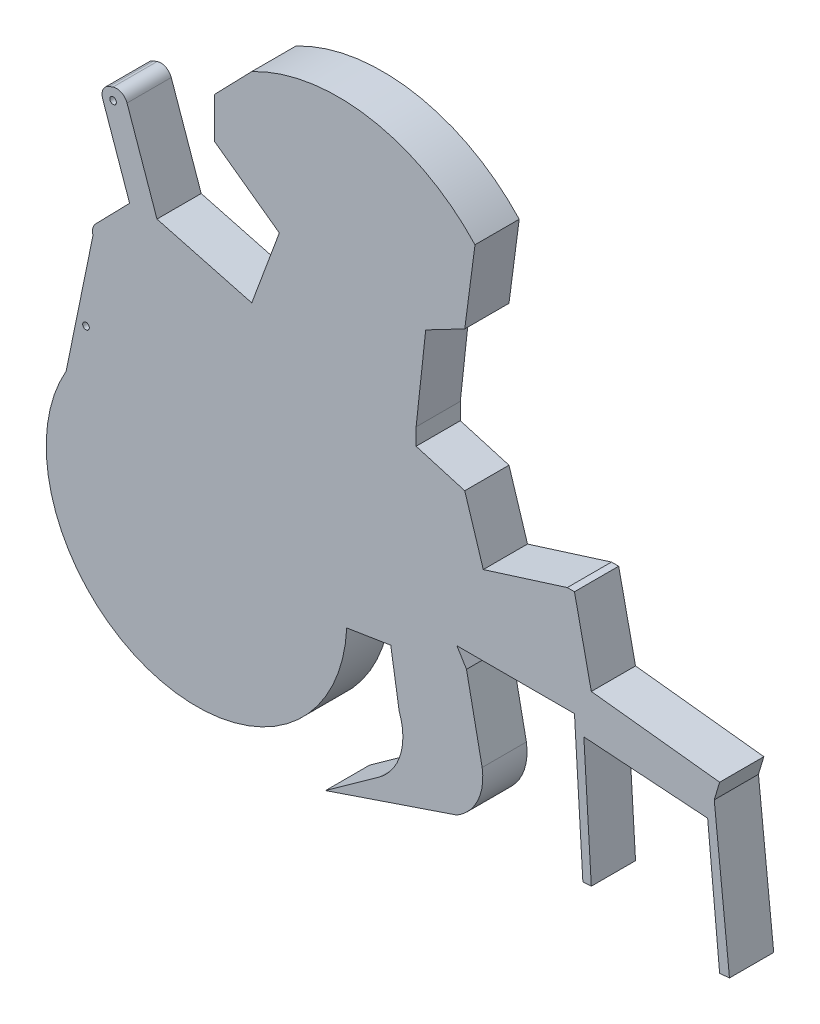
ISO-10303-21;
HEADER;
FILE_DESCRIPTION(('STEP AP214'),'2;1');
FILE_NAME('part.step','',(''),(''),'','','');
FILE_SCHEMA(('AUTOMOTIVE_DESIGN { 1 0 10303 214 1 1 1 1 }'));
ENDSEC;
DATA;
#1=APPLICATION_CONTEXT('core data for automotive mechanical design processes');
#2=APPLICATION_PROTOCOL_DEFINITION('international standard','automotive_design',2000,#1);
#3=PRODUCT_CONTEXT('',#1,'mechanical');
#4=PRODUCT('Part','Part','',(#3));
#5=PRODUCT_RELATED_PRODUCT_CATEGORY('part','',(#4));
#6=PRODUCT_DEFINITION_FORMATION('','',#4);
#7=PRODUCT_DEFINITION_CONTEXT('part definition',#1,'design');
#8=PRODUCT_DEFINITION('design','',#6,#7);
#9=PRODUCT_DEFINITION_SHAPE('','',#8);
#10=(LENGTH_UNIT() NAMED_UNIT(*) SI_UNIT(.MILLI.,.METRE.));
#11=(NAMED_UNIT(*) PLANE_ANGLE_UNIT() SI_UNIT($,.RADIAN.));
#12=(NAMED_UNIT(*) SI_UNIT($,.STERADIAN.) SOLID_ANGLE_UNIT());
#13=UNCERTAINTY_MEASURE_WITH_UNIT(LENGTH_MEASURE(1.E-05),#10,'distance_accuracy_value','');
#14=(GEOMETRIC_REPRESENTATION_CONTEXT(3) GLOBAL_UNCERTAINTY_ASSIGNED_CONTEXT((#13)) GLOBAL_UNIT_ASSIGNED_CONTEXT((#10,
#11,#12)) REPRESENTATION_CONTEXT('',''));
#15=CARTESIAN_POINT('',(0.,0.,0.));
#16=DIRECTION('',(0.,0.,1.));
#17=DIRECTION('',(1.,0.,0.));
#18=AXIS2_PLACEMENT_3D('',#15,#16,#17);
#19=CARTESIAN_POINT('',(-429.518030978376,520.510767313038,-59.1500000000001));
#20=DIRECTION('',(0.,0.,1.));
#21=DIRECTION('',(1.,0.,0.));
#22=AXIS2_PLACEMENT_3D('',#19,#20,#21);
#23=CYLINDRICAL_SURFACE('',#22,27.075);
#24=CARTESIAN_POINT('',(-429.518030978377,520.510767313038,49.1499999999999));
#25=DIRECTION('',(0.,0.,1.));
#26=DIRECTION('',(-1.,0.,0.));
#27=AXIS2_PLACEMENT_3D('',#24,#25,#26);
#28=CIRCLE('',#27,27.075);
#29=CARTESIAN_POINT('',(-403.963065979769,529.455005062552,49.15));
#30=VERTEX_POINT('',#29);
#31=CARTESIAN_POINT('',(-438.462268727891,546.065732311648,49.15));
#32=VERTEX_POINT('',#31);
#33=EDGE_CURVE('E308',#30,#32,#28,.T.);
#34=ORIENTED_EDGE('',*,*,#33,.F.);
#35=DIRECTION('',(0.,0.,1.));
#36=VECTOR('',#35,1.);
#37=CARTESIAN_POINT('',(-403.963065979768,529.455005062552,-59.15));
#38=LINE('',#37,#36);
#39=CARTESIAN_POINT('',(-403.963065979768,529.455005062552,-59.15));
#40=VERTEX_POINT('',#39);
#41=EDGE_CURVE('E11',#40,#30,#38,.T.);
#42=ORIENTED_EDGE('',*,*,#41,.F.);
#43=CARTESIAN_POINT('',(-429.518030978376,520.510767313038,-59.1500000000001));
#44=DIRECTION('',(0.,0.,1.));
#45=DIRECTION('',(-1.,0.,0.));
#46=AXIS2_PLACEMENT_3D('',#43,#44,#45);
#47=CIRCLE('',#46,27.075);
#48=CARTESIAN_POINT('',(-438.462268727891,546.065732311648,-59.15));
#49=VERTEX_POINT('',#48);
#50=EDGE_CURVE('E310',#40,#49,#47,.T.);
#51=ORIENTED_EDGE('',*,*,#50,.T.);
#52=DIRECTION('',(0.,0.,1.));
#53=VECTOR('',#52,1.);
#54=CARTESIAN_POINT('',(-438.462268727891,546.065732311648,-59.15));
#55=LINE('',#54,#53);
#56=EDGE_CURVE('E43',#49,#32,#55,.T.);
#57=ORIENTED_EDGE('',*,*,#56,.T.);
#58=EDGE_LOOP('',(#34,#42,#51,#57));
#59=FACE_BOUND('',#58,.T.);
#60=ADVANCED_FACE('F40',(#59),#23,.T.);
#61=CARTESIAN_POINT('',(-330.649773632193,319.988455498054,-59.15));
#62=DIRECTION('',(0.943858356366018,0.330350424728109,0.));
#63=DIRECTION('',(-0.330350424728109,0.943858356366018,0.));
#64=AXIS2_PLACEMENT_3D('',#61,#62,#63);
#65=PLANE('',#64);
#66=DIRECTION('',(-0.330350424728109,0.943858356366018,0.));
#67=VECTOR('',#66,1.);
#68=CARTESIAN_POINT('',(-330.649773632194,319.988455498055,49.1499999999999));
#69=LINE('',#68,#67);
#70=CARTESIAN_POINT('',(-330.649773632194,319.988455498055,49.1499999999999));
#71=VERTEX_POINT('',#70);
#72=EDGE_CURVE('E326',#71,#30,#69,.T.);
#73=ORIENTED_EDGE('',*,*,#72,.F.);
#74=DIRECTION('',(0.,0.,1.));
#75=VECTOR('',#74,1.);
#76=CARTESIAN_POINT('',(-330.649773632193,319.988455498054,-59.15));
#77=LINE('',#76,#75);
#78=CARTESIAN_POINT('',(-330.649773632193,319.988455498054,-59.15));
#79=VERTEX_POINT('',#78);
#80=EDGE_CURVE('E48',#79,#71,#77,.T.);
#81=ORIENTED_EDGE('',*,*,#80,.F.);
#82=DIRECTION('',(-0.330350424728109,0.943858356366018,0.));
#83=VECTOR('',#82,1.);
#84=CARTESIAN_POINT('',(-330.649773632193,319.988455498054,-59.15));
#85=LINE('',#84,#83);
#86=EDGE_CURVE('E315',#79,#40,#85,.T.);
#87=ORIENTED_EDGE('',*,*,#86,.T.);
#88=ORIENTED_EDGE('',*,*,#41,.T.);
#89=EDGE_LOOP('',(#73,#81,#87,#88));
#90=FACE_BOUND('',#89,.T.);
#91=ADVANCED_FACE('F800',(#90),#65,.T.);
#92=CARTESIAN_POINT('',(-98.5660280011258,258.29530792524,-59.15));
#93=DIRECTION('',(0.256901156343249,0.96643768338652,0.));
#94=DIRECTION('',(-0.96643768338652,0.256901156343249,0.));
#95=AXIS2_PLACEMENT_3D('',#92,#93,#94);
#96=PLANE('',#95);
#97=DIRECTION('',(-0.96643768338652,0.256901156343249,0.));
#98=VECTOR('',#97,1.);
#99=CARTESIAN_POINT('',(-98.5660280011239,258.29530792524,49.15));
#100=LINE('',#99,#98);
#101=CARTESIAN_POINT('',(-98.5660280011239,258.29530792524,49.15));
#102=VERTEX_POINT('',#101);
#103=EDGE_CURVE('E446',#102,#71,#100,.T.);
#104=ORIENTED_EDGE('',*,*,#103,.F.);
#105=DIRECTION('',(0.,0.,1.));
#106=VECTOR('',#105,1.);
#107=CARTESIAN_POINT('',(-98.5660280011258,258.29530792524,-59.15));
#108=LINE('',#107,#106);
#109=CARTESIAN_POINT('',(-98.5660280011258,258.29530792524,-59.15));
#110=VERTEX_POINT('',#109);
#111=EDGE_CURVE('E569',#110,#102,#108,.T.);
#112=ORIENTED_EDGE('',*,*,#111,.F.);
#113=DIRECTION('',(-0.96643768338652,0.256901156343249,0.));
#114=VECTOR('',#113,1.);
#115=CARTESIAN_POINT('',(-98.5660280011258,258.29530792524,-59.15));
#116=LINE('',#115,#114);
#117=EDGE_CURVE('E565',#110,#79,#116,.T.);
#118=ORIENTED_EDGE('',*,*,#117,.T.);
#119=ORIENTED_EDGE('',*,*,#80,.T.);
#120=EDGE_LOOP('',(#104,#112,#118,#119));
#121=FACE_BOUND('',#120,.T.);
#122=ADVANCED_FACE('F803',(#121),#96,.T.);
#123=CARTESIAN_POINT('',(-30.9973425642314,440.436981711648,-59.15));
#124=DIRECTION('',(-0.937566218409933,0.347806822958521,0.));
#125=DIRECTION('',(-0.347806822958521,-0.937566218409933,0.));
#126=AXIS2_PLACEMENT_3D('',#123,#124,#125);
#127=PLANE('',#126);
#128=DIRECTION('',(-0.347806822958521,-0.937566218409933,0.));
#129=VECTOR('',#128,1.);
#130=CARTESIAN_POINT('',(-30.9973425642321,440.436981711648,49.15));
#131=LINE('',#130,#129);
#132=CARTESIAN_POINT('',(-30.9973425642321,440.436981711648,49.15));
#133=VERTEX_POINT('',#132);
#134=EDGE_CURVE('E443',#133,#102,#131,.T.);
#135=ORIENTED_EDGE('',*,*,#134,.F.);
#136=DIRECTION('',(0.,0.,1.));
#137=VECTOR('',#136,1.);
#138=CARTESIAN_POINT('',(-30.9973425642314,440.436981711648,-59.15));
#139=LINE('',#138,#137);
#140=CARTESIAN_POINT('',(-30.9973425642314,440.436981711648,-59.15));
#141=VERTEX_POINT('',#140);
#142=EDGE_CURVE('E571',#141,#133,#139,.T.);
#143=ORIENTED_EDGE('',*,*,#142,.F.);
#144=DIRECTION('',(-0.347806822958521,-0.937566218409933,0.));
#145=VECTOR('',#144,1.);
#146=CARTESIAN_POINT('',(-30.9973425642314,440.436981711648,-59.15));
#147=LINE('',#146,#145);
#148=EDGE_CURVE('E562',#141,#110,#147,.T.);
#149=ORIENTED_EDGE('',*,*,#148,.T.);
#150=ORIENTED_EDGE('',*,*,#111,.T.);
#151=EDGE_LOOP('',(#135,#143,#149,#150));
#152=FACE_BOUND('',#151,.T.);
#153=ADVANCED_FACE('F797',(#152),#127,.T.);
#154=CARTESIAN_POINT('',(-189.636864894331,555.009970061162,-59.15));
#155=DIRECTION('',(-0.585490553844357,-0.810679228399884,0.));
#156=DIRECTION('',(0.810679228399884,-0.585490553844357,0.));
#157=AXIS2_PLACEMENT_3D('',#154,#155,#156);
#158=PLANE('',#157);
#159=DIRECTION('',(0.810679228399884,-0.585490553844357,0.));
#160=VECTOR('',#159,1.);
#161=CARTESIAN_POINT('',(-189.636864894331,555.009970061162,49.15));
#162=LINE('',#161,#160);
#163=CARTESIAN_POINT('',(-189.636864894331,555.009970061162,49.15));
#164=VERTEX_POINT('',#163);
#165=EDGE_CURVE('E440',#164,#133,#162,.T.);
#166=ORIENTED_EDGE('',*,*,#165,.F.);
#167=DIRECTION('',(0.,0.,1.));
#168=VECTOR('',#167,1.);
#169=CARTESIAN_POINT('',(-189.636864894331,555.009970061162,-59.15));
#170=LINE('',#169,#168);
#171=CARTESIAN_POINT('',(-189.636864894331,555.009970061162,-59.15));
#172=VERTEX_POINT('',#171);
#173=EDGE_CURVE('E573',#172,#164,#170,.T.);
#174=ORIENTED_EDGE('',*,*,#173,.F.);
#175=DIRECTION('',(0.810679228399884,-0.585490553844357,0.));
#176=VECTOR('',#175,1.);
#177=CARTESIAN_POINT('',(-189.636864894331,555.009970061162,-59.15));
#178=LINE('',#177,#176);
#179=EDGE_CURVE('E559',#172,#141,#178,.T.);
#180=ORIENTED_EDGE('',*,*,#179,.T.);
#181=ORIENTED_EDGE('',*,*,#142,.T.);
#182=EDGE_LOOP('',(#166,#174,#180,#181));
#183=FACE_BOUND('',#182,.T.);
#184=ADVANCED_FACE('F793',(#183),#158,.T.);
#185=CARTESIAN_POINT('',(-189.636864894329,654.894113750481,-59.1499999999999));
#186=DIRECTION('',(-1.,0.,0.));
#187=DIRECTION('',(0.,-1.,0.));
#188=AXIS2_PLACEMENT_3D('',#185,#186,#187);
#189=PLANE('',#188);
#190=DIRECTION('',(0.,-1.,0.));
#191=VECTOR('',#190,1.);
#192=CARTESIAN_POINT('',(-189.63686489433,654.894113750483,49.1499999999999));
#193=LINE('',#192,#191);
#194=CARTESIAN_POINT('',(-189.63686489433,654.894113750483,49.1499999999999));
#195=VERTEX_POINT('',#194);
#196=EDGE_CURVE('E437',#195,#164,#193,.T.);
#197=ORIENTED_EDGE('',*,*,#196,.F.);
#198=DIRECTION('',(0.,0.,1.));
#199=VECTOR('',#198,1.);
#200=CARTESIAN_POINT('',(-189.636864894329,654.894113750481,-59.1499999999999));
#201=LINE('',#200,#199);
#202=CARTESIAN_POINT('',(-189.636864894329,654.894113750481,-59.1499999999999));
#203=VERTEX_POINT('',#202);
#204=EDGE_CURVE('E575',#203,#195,#201,.T.);
#205=ORIENTED_EDGE('',*,*,#204,.F.);
#206=DIRECTION('',(0.,-1.,0.));
#207=VECTOR('',#206,1.);
#208=CARTESIAN_POINT('',(-189.636864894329,654.894113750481,-59.1499999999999));
#209=LINE('',#208,#207);
#210=EDGE_CURVE('E556',#203,#172,#209,.T.);
#211=ORIENTED_EDGE('',*,*,#210,.T.);
#212=ORIENTED_EDGE('',*,*,#173,.T.);
#213=EDGE_LOOP('',(#197,#205,#211,#212));
#214=FACE_BOUND('',#213,.T.);
#215=ADVANCED_FACE('F789',(#214),#189,.T.);
#216=CARTESIAN_POINT('',(-98.5660280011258,748.902719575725,-59.15));
#217=DIRECTION('',(-0.718240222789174,0.695795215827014,0.));
#218=DIRECTION('',(-0.695795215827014,-0.718240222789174,0.));
#219=AXIS2_PLACEMENT_3D('',#216,#217,#218);
#220=PLANE('',#219);
#221=DIRECTION('',(-0.695795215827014,-0.718240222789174,0.));
#222=VECTOR('',#221,1.);
#223=CARTESIAN_POINT('',(-98.5660280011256,748.902719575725,49.15));
#224=LINE('',#223,#222);
#225=CARTESIAN_POINT('',(-98.5660280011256,748.902719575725,49.15));
#226=VERTEX_POINT('',#225);
#227=EDGE_CURVE('E434',#226,#195,#224,.T.);
#228=ORIENTED_EDGE('',*,*,#227,.F.);
#229=DIRECTION('',(0.,0.,1.));
#230=VECTOR('',#229,1.);
#231=CARTESIAN_POINT('',(-98.5660280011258,748.902719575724,-59.15));
#232=LINE('',#231,#230);
#233=CARTESIAN_POINT('',(-98.5660280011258,748.902719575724,-59.15));
#234=VERTEX_POINT('',#233);
#235=EDGE_CURVE('E577',#234,#226,#232,.T.);
#236=ORIENTED_EDGE('',*,*,#235,.F.);
#237=DIRECTION('',(-0.695795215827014,-0.718240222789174,0.));
#238=VECTOR('',#237,1.);
#239=CARTESIAN_POINT('',(-98.5660280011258,748.902719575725,-59.15));
#240=LINE('',#239,#238);
#241=EDGE_CURVE('E553',#234,#203,#240,.T.);
#242=ORIENTED_EDGE('',*,*,#241,.T.);
#243=ORIENTED_EDGE('',*,*,#204,.T.);
#244=EDGE_LOOP('',(#228,#236,#242,#243));
#245=FACE_BOUND('',#244,.T.);
#246=ADVANCED_FACE('F785',(#245),#220,.T.);
#247=CARTESIAN_POINT('',(113.468315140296,345.404291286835,-59.1499999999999));
#248=DIRECTION('',(0.,0.,1.));
#249=DIRECTION('',(1.,0.,0.));
#250=AXIS2_PLACEMENT_3D('',#247,#248,#249);
#251=CYLINDRICAL_SURFACE('',#250,455.81744624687);
#252=CARTESIAN_POINT('',(113.468315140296,345.404291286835,49.1499999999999));
#253=DIRECTION('',(0.,0.,1.));
#254=DIRECTION('',(-1.,0.,0.));
#255=AXIS2_PLACEMENT_3D('',#252,#253,#254);
#256=CIRCLE('',#255,455.81744624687);
#257=CARTESIAN_POINT('',(448.110802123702,654.894113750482,49.1499999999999));
#258=VERTEX_POINT('',#257);
#259=EDGE_CURVE('E431',#258,#226,#256,.T.);
#260=ORIENTED_EDGE('',*,*,#259,.F.);
#261=DIRECTION('',(0.,0.,1.));
#262=VECTOR('',#261,1.);
#263=CARTESIAN_POINT('',(448.110802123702,654.894113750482,-59.15));
#264=LINE('',#263,#262);
#265=CARTESIAN_POINT('',(448.110802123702,654.894113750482,-59.15));
#266=VERTEX_POINT('',#265);
#267=EDGE_CURVE('E579',#266,#258,#264,.T.);
#268=ORIENTED_EDGE('',*,*,#267,.F.);
#269=CARTESIAN_POINT('',(113.468315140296,345.404291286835,-59.1499999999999));
#270=DIRECTION('',(0.,0.,1.));
#271=DIRECTION('',(-1.,0.,0.));
#272=AXIS2_PLACEMENT_3D('',#269,#270,#271);
#273=CIRCLE('',#272,455.81744624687);
#274=EDGE_CURVE('E550',#266,#234,#273,.T.);
#275=ORIENTED_EDGE('',*,*,#274,.T.);
#276=ORIENTED_EDGE('',*,*,#235,.T.);
#277=EDGE_LOOP('',(#260,#268,#275,#276));
#278=FACE_BOUND('',#277,.T.);
#279=ADVANCED_FACE('F781',(#278),#251,.T.);
#280=CARTESIAN_POINT('',(423.023278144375,463.939133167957,-59.15));
#281=DIRECTION('',(0.991479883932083,-0.130259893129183,0.));
#282=DIRECTION('',(0.130259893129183,0.991479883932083,0.));
#283=AXIS2_PLACEMENT_3D('',#280,#281,#282);
#284=PLANE('',#283);
#285=DIRECTION('',(0.130259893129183,0.991479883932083,0.));
#286=VECTOR('',#285,1.);
#287=CARTESIAN_POINT('',(423.023278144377,463.939133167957,49.1499999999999));
#288=LINE('',#287,#286);
#289=CARTESIAN_POINT('',(423.023278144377,463.939133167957,49.1499999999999));
#290=VERTEX_POINT('',#289);
#291=EDGE_CURVE('E428',#290,#258,#288,.T.);
#292=ORIENTED_EDGE('',*,*,#291,.F.);
#293=DIRECTION('',(0.,0.,1.));
#294=VECTOR('',#293,1.);
#295=CARTESIAN_POINT('',(423.023278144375,463.939133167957,-59.15));
#296=LINE('',#295,#294);
#297=CARTESIAN_POINT('',(423.023278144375,463.939133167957,-59.15));
#298=VERTEX_POINT('',#297);
#299=EDGE_CURVE('E581',#298,#290,#296,.T.);
#300=ORIENTED_EDGE('',*,*,#299,.F.);
#301=DIRECTION('',(0.130259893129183,0.991479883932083,0.));
#302=VECTOR('',#301,1.);
#303=CARTESIAN_POINT('',(423.023278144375,463.939133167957,-59.15));
#304=LINE('',#303,#302);
#305=EDGE_CURVE('E547',#298,#266,#304,.T.);
#306=ORIENTED_EDGE('',*,*,#305,.T.);
#307=ORIENTED_EDGE('',*,*,#267,.T.);
#308=EDGE_LOOP('',(#292,#300,#306,#307));
#309=FACE_BOUND('',#308,.T.);
#310=ADVANCED_FACE('F777',(#309),#284,.T.);
#311=CARTESIAN_POINT('',(327.410467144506,413.997061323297,-59.15));
#312=DIRECTION('',(0.462982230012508,-0.886367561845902,0.));
#313=DIRECTION('',(0.886367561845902,0.462982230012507,0.));
#314=AXIS2_PLACEMENT_3D('',#311,#312,#313);
#315=PLANE('',#314);
#316=DIRECTION('',(0.886367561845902,0.462982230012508,0.));
#317=VECTOR('',#316,1.);
#318=CARTESIAN_POINT('',(327.410467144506,413.997061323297,49.15));
#319=LINE('',#318,#317);
#320=CARTESIAN_POINT('',(327.410467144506,413.997061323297,49.15));
#321=VERTEX_POINT('',#320);
#322=EDGE_CURVE('E425',#321,#290,#319,.T.);
#323=ORIENTED_EDGE('',*,*,#322,.F.);
#324=DIRECTION('',(0.,0.,1.));
#325=VECTOR('',#324,1.);
#326=CARTESIAN_POINT('',(327.410467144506,413.997061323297,-59.15));
#327=LINE('',#326,#325);
#328=CARTESIAN_POINT('',(327.410467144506,413.997061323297,-59.15));
#329=VERTEX_POINT('',#328);
#330=EDGE_CURVE('E583',#329,#321,#327,.T.);
#331=ORIENTED_EDGE('',*,*,#330,.F.);
#332=DIRECTION('',(0.886367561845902,0.462982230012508,0.));
#333=VECTOR('',#332,1.);
#334=CARTESIAN_POINT('',(327.410467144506,413.997061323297,-59.15));
#335=LINE('',#334,#333);
#336=EDGE_CURVE('E544',#329,#298,#335,.T.);
#337=ORIENTED_EDGE('',*,*,#336,.T.);
#338=ORIENTED_EDGE('',*,*,#299,.T.);
#339=EDGE_LOOP('',(#323,#331,#337,#338));
#340=FACE_BOUND('',#339,.T.);
#341=ADVANCED_FACE('F773',(#340),#315,.T.);
#342=CARTESIAN_POINT('',(303.908315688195,196.602160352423,-59.1499999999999));
#343=DIRECTION('',(0.994207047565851,-0.107481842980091,0.));
#344=DIRECTION('',(0.107481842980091,0.994207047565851,0.));
#345=AXIS2_PLACEMENT_3D('',#342,#343,#344);
#346=PLANE('',#345);
#347=DIRECTION('',(0.107481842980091,0.994207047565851,0.));
#348=VECTOR('',#347,1.);
#349=CARTESIAN_POINT('',(303.908315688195,196.602160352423,49.1499999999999));
#350=LINE('',#349,#348);
#351=CARTESIAN_POINT('',(303.908315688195,196.602160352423,49.1499999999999));
#352=VERTEX_POINT('',#351);
#353=EDGE_CURVE('E422',#352,#321,#350,.T.);
#354=ORIENTED_EDGE('',*,*,#353,.F.);
#355=DIRECTION('',(0.,0.,1.));
#356=VECTOR('',#355,1.);
#357=CARTESIAN_POINT('',(303.908315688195,196.602160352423,-59.1499999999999));
#358=LINE('',#357,#356);
#359=CARTESIAN_POINT('',(303.908315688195,196.602160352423,-59.1499999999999));
#360=VERTEX_POINT('',#359);
#361=EDGE_CURVE('E585',#360,#352,#358,.T.);
#362=ORIENTED_EDGE('',*,*,#361,.F.);
#363=DIRECTION('',(0.107481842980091,0.994207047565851,0.));
#364=VECTOR('',#363,1.);
#365=CARTESIAN_POINT('',(303.908315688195,196.602160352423,-59.1499999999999));
#366=LINE('',#365,#364);
#367=EDGE_CURVE('E541',#360,#329,#366,.T.);
#368=ORIENTED_EDGE('',*,*,#367,.T.);
#369=ORIENTED_EDGE('',*,*,#330,.T.);
#370=EDGE_LOOP('',(#354,#362,#368,#369));
#371=FACE_BOUND('',#370,.T.);
#372=ADVANCED_FACE('F769',(#371),#346,.T.);
#373=CARTESIAN_POINT('',(303.908315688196,155.47339530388,-59.15));
#374=DIRECTION('',(1.,0.,0.));
#375=DIRECTION('',(0.,0.,-1.));
#376=AXIS2_PLACEMENT_3D('',#373,#374,#375);
#377=PLANE('',#376);
#378=DIRECTION('',(0.,1.,0.));
#379=VECTOR('',#378,1.);
#380=CARTESIAN_POINT('',(303.908315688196,155.47339530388,49.15));
#381=LINE('',#380,#379);
#382=CARTESIAN_POINT('',(303.908315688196,155.47339530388,49.15));
#383=VERTEX_POINT('',#382);
#384=EDGE_CURVE('E419',#383,#352,#381,.T.);
#385=ORIENTED_EDGE('',*,*,#384,.F.);
#386=DIRECTION('',(0.,0.,1.));
#387=VECTOR('',#386,1.);
#388=CARTESIAN_POINT('',(303.908315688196,155.47339530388,-59.15));
#389=LINE('',#388,#387);
#390=CARTESIAN_POINT('',(303.908315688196,155.47339530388,-59.15));
#391=VERTEX_POINT('',#390);
#392=EDGE_CURVE('E587',#391,#383,#389,.T.);
#393=ORIENTED_EDGE('',*,*,#392,.F.);
#394=DIRECTION('',(0.,1.,0.));
#395=VECTOR('',#394,1.);
#396=CARTESIAN_POINT('',(303.908315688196,155.47339530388,-59.15));
#397=LINE('',#396,#395);
#398=EDGE_CURVE('E538',#391,#360,#397,.T.);
#399=ORIENTED_EDGE('',*,*,#398,.T.);
#400=ORIENTED_EDGE('',*,*,#361,.T.);
#401=EDGE_LOOP('',(#385,#393,#399,#400));
#402=FACE_BOUND('',#401,.T.);
#403=ADVANCED_FACE('F767',(#402),#377,.T.);
#404=CARTESIAN_POINT('',(423.023278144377,120.724346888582,-59.15));
#405=DIRECTION('',(0.28005336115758,0.959984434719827,0.));
#406=DIRECTION('',(-0.959984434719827,0.28005336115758,0.));
#407=AXIS2_PLACEMENT_3D('',#404,#405,#406);
#408=PLANE('',#407);
#409=DIRECTION('',(-0.959984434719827,0.28005336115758,0.));
#410=VECTOR('',#409,1.);
#411=CARTESIAN_POINT('',(423.023278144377,120.724346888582,49.1499999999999));
#412=LINE('',#411,#410);
#413=CARTESIAN_POINT('',(423.023278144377,120.724346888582,49.1499999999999));
#414=VERTEX_POINT('',#413);
#415=EDGE_CURVE('E416',#414,#383,#412,.T.);
#416=ORIENTED_EDGE('',*,*,#415,.F.);
#417=DIRECTION('',(0.,0.,1.));
#418=VECTOR('',#417,1.);
#419=CARTESIAN_POINT('',(423.023278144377,120.724346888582,-59.15));
#420=LINE('',#419,#418);
#421=CARTESIAN_POINT('',(423.023278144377,120.724346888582,-59.15));
#422=VERTEX_POINT('',#421);
#423=EDGE_CURVE('E589',#422,#414,#420,.T.);
#424=ORIENTED_EDGE('',*,*,#423,.F.);
#425=DIRECTION('',(-0.959984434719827,0.28005336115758,0.));
#426=VECTOR('',#425,1.);
#427=CARTESIAN_POINT('',(423.023278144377,120.724346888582,-59.15));
#428=LINE('',#427,#426);
#429=EDGE_CURVE('E535',#422,#391,#428,.T.);
#430=ORIENTED_EDGE('',*,*,#429,.T.);
#431=ORIENTED_EDGE('',*,*,#392,.T.);
#432=EDGE_LOOP('',(#416,#424,#430,#431));
#433=FACE_BOUND('',#432,.T.);
#434=ADVANCED_FACE('F763',(#433),#408,.T.);
#435=CARTESIAN_POINT('',(448.110802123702,40.9004069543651,-59.15));
#436=DIRECTION('',(0.953993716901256,0.299826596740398,0.));
#437=DIRECTION('',(-0.299826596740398,0.953993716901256,0.));
#438=AXIS2_PLACEMENT_3D('',#435,#436,#437);
#439=PLANE('',#438);
#440=DIRECTION('',(-0.299826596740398,0.953993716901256,0.));
#441=VECTOR('',#440,1.);
#442=CARTESIAN_POINT('',(448.110802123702,40.9004069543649,49.15));
#443=LINE('',#442,#441);
#444=CARTESIAN_POINT('',(468.423375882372,-23.7305095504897,49.15));
#445=VERTEX_POINT('',#444);
#446=EDGE_CURVE('E413',#445,#414,#443,.T.);
#447=ORIENTED_EDGE('',*,*,#446,.F.);
#448=DIRECTION('',(0.,0.,1.));
#449=VECTOR('',#448,1.);
#450=CARTESIAN_POINT('',(468.42337588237,-23.7305095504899,-59.15));
#451=LINE('',#450,#449);
#452=CARTESIAN_POINT('',(468.42337588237,-23.7305095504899,-59.15));
#453=VERTEX_POINT('',#452);
#454=EDGE_CURVE('E591',#453,#445,#451,.T.);
#455=ORIENTED_EDGE('',*,*,#454,.F.);
#456=DIRECTION('',(-0.299826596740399,0.953993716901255,0.));
#457=VECTOR('',#456,1.);
#458=CARTESIAN_POINT('',(468.42337588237,-23.7305095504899,-59.15));
#459=LINE('',#458,#457);
#460=EDGE_CURVE('E533',#453,#422,#459,.T.);
#461=ORIENTED_EDGE('',*,*,#460,.T.);
#462=ORIENTED_EDGE('',*,*,#423,.T.);
#463=EDGE_LOOP('',(#447,#455,#461,#462));
#464=FACE_BOUND('',#463,.T.);
#465=ADVANCED_FACE('F754',(#464),#439,.T.);
#466=CARTESIAN_POINT('',(674.067201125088,40.9004069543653,-59.15));
#467=DIRECTION('',(-0.299826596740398,0.953993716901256,0.));
#468=DIRECTION('',(-0.953993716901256,-0.299826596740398,0.));
#469=AXIS2_PLACEMENT_3D('',#466,#467,#468);
#470=PLANE('',#469);
#471=DIRECTION('',(-0.953993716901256,-0.299826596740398,0.));
#472=VECTOR('',#471,1.);
#473=CARTESIAN_POINT('',(674.067201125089,40.9004069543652,49.1499999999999));
#474=LINE('',#473,#472);
#475=CARTESIAN_POINT('',(674.067201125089,40.9004069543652,49.1499999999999));
#476=VERTEX_POINT('',#475);
#477=EDGE_CURVE('E410',#476,#445,#474,.T.);
#478=ORIENTED_EDGE('',*,*,#477,.F.);
#479=DIRECTION('',(0.,0.,1.));
#480=VECTOR('',#479,1.);
#481=CARTESIAN_POINT('',(674.067201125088,40.9004069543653,-59.15));
#482=LINE('',#481,#480);
#483=CARTESIAN_POINT('',(674.067201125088,40.9004069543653,-59.15));
#484=VERTEX_POINT('',#483);
#485=EDGE_CURVE('E594',#484,#476,#482,.T.);
#486=ORIENTED_EDGE('',*,*,#485,.F.);
#487=DIRECTION('',(-0.953993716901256,-0.299826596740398,0.));
#488=VECTOR('',#487,1.);
#489=CARTESIAN_POINT('',(674.067201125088,40.9004069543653,-59.15));
#490=LINE('',#489,#488);
#491=EDGE_CURVE('E530',#484,#453,#490,.T.);
#492=ORIENTED_EDGE('',*,*,#491,.T.);
#493=ORIENTED_EDGE('',*,*,#454,.T.);
#494=EDGE_LOOP('',(#478,#486,#492,#493));
#495=FACE_BOUND('',#494,.T.);
#496=ADVANCED_FACE('F750',(#495),#470,.T.);
#497=CARTESIAN_POINT('',(691.693814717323,40.9004069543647,-59.15));
#498=DIRECTION('',(0.,1.,0.));
#499=DIRECTION('',(-1.,0.,0.));
#500=AXIS2_PLACEMENT_3D('',#497,#498,#499);
#501=PLANE('',#500);
#502=DIRECTION('',(-1.,0.,0.));
#503=VECTOR('',#502,1.);
#504=CARTESIAN_POINT('',(691.693814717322,40.9004069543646,49.15));
#505=LINE('',#504,#503);
#506=CARTESIAN_POINT('',(691.693814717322,40.9004069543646,49.15));
#507=VERTEX_POINT('',#506);
#508=EDGE_CURVE('E407',#507,#476,#505,.T.);
#509=ORIENTED_EDGE('',*,*,#508,.F.);
#510=DIRECTION('',(0.,0.,1.));
#511=VECTOR('',#510,1.);
#512=CARTESIAN_POINT('',(691.693814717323,40.9004069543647,-59.15));
#513=LINE('',#512,#511);
#514=CARTESIAN_POINT('',(691.693814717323,40.9004069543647,-59.15));
#515=VERTEX_POINT('',#514);
#516=EDGE_CURVE('E596',#515,#507,#513,.T.);
#517=ORIENTED_EDGE('',*,*,#516,.F.);
#518=DIRECTION('',(-1.,0.,0.));
#519=VECTOR('',#518,1.);
#520=CARTESIAN_POINT('',(691.693814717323,40.9004069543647,-59.15));
#521=LINE('',#520,#519);
#522=EDGE_CURVE('E527',#515,#484,#521,.T.);
#523=ORIENTED_EDGE('',*,*,#522,.T.);
#524=ORIENTED_EDGE('',*,*,#485,.T.);
#525=EDGE_LOOP('',(#509,#517,#523,#524));
#526=FACE_BOUND('',#525,.T.);
#527=ADVANCED_FACE('F747',(#526),#501,.T.);
#528=CARTESIAN_POINT('',(732.924128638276,-150.05457362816,-59.15));
#529=DIRECTION('',(0.977474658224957,0.211052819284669,0.));
#530=DIRECTION('',(-0.211052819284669,0.977474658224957,0.));
#531=AXIS2_PLACEMENT_3D('',#528,#529,#530);
#532=PLANE('',#531);
#533=DIRECTION('',(-0.211052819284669,0.977474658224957,0.));
#534=VECTOR('',#533,1.);
#535=CARTESIAN_POINT('',(732.924128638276,-150.05457362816,49.15));
#536=LINE('',#535,#534);
#537=CARTESIAN_POINT('',(732.924128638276,-150.05457362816,49.15));
#538=VERTEX_POINT('',#537);
#539=EDGE_CURVE('E404',#538,#507,#536,.T.);
#540=ORIENTED_EDGE('',*,*,#539,.F.);
#541=DIRECTION('',(0.,0.,1.));
#542=VECTOR('',#541,1.);
#543=CARTESIAN_POINT('',(732.924128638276,-150.05457362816,-59.15));
#544=LINE('',#543,#542);
#545=CARTESIAN_POINT('',(732.924128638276,-150.05457362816,-59.15));
#546=VERTEX_POINT('',#545);
#547=EDGE_CURVE('E598',#546,#538,#544,.T.);
#548=ORIENTED_EDGE('',*,*,#547,.F.);
#549=DIRECTION('',(-0.211052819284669,0.977474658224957,0.));
#550=VECTOR('',#549,1.);
#551=CARTESIAN_POINT('',(732.924128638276,-150.05457362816,-59.15));
#552=LINE('',#551,#550);
#553=EDGE_CURVE('E524',#546,#515,#552,.T.);
#554=ORIENTED_EDGE('',*,*,#553,.T.);
#555=ORIENTED_EDGE('',*,*,#516,.T.);
#556=EDGE_LOOP('',(#540,#548,#554,#555));
#557=FACE_BOUND('',#556,.T.);
#558=ADVANCED_FACE('F743',(#557),#532,.T.);
#559=CARTESIAN_POINT('',(1047.16385549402,-185.307800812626,-59.15));
#560=DIRECTION('',(0.111486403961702,0.993765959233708,0.));
#561=DIRECTION('',(-0.993765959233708,0.111486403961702,0.));
#562=AXIS2_PLACEMENT_3D('',#559,#560,#561);
#563=PLANE('',#562);
#564=DIRECTION('',(-0.993765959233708,0.111486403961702,0.));
#565=VECTOR('',#564,1.);
#566=CARTESIAN_POINT('',(1047.16385549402,-185.307800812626,49.1499999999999));
#567=LINE('',#566,#565);
#568=CARTESIAN_POINT('',(1047.16385549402,-185.307800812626,49.1499999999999));
#569=VERTEX_POINT('',#568);
#570=EDGE_CURVE('E401',#569,#538,#567,.T.);
#571=ORIENTED_EDGE('',*,*,#570,.F.);
#572=DIRECTION('',(0.,0.,1.));
#573=VECTOR('',#572,1.);
#574=CARTESIAN_POINT('',(1047.16385549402,-185.307800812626,-59.15));
#575=LINE('',#574,#573);
#576=CARTESIAN_POINT('',(1047.16385549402,-185.307800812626,-59.15));
#577=VERTEX_POINT('',#576);
#578=EDGE_CURVE('E600',#577,#569,#575,.T.);
#579=ORIENTED_EDGE('',*,*,#578,.F.);
#580=DIRECTION('',(-0.993765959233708,0.111486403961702,0.));
#581=VECTOR('',#580,1.);
#582=CARTESIAN_POINT('',(1047.16385549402,-185.307800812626,-59.15));
#583=LINE('',#582,#581);
#584=EDGE_CURVE('E521',#577,#546,#583,.T.);
#585=ORIENTED_EDGE('',*,*,#584,.T.);
#586=ORIENTED_EDGE('',*,*,#547,.T.);
#587=EDGE_LOOP('',(#571,#579,#585,#586));
#588=FACE_BOUND('',#587,.T.);
#589=ADVANCED_FACE('F739',(#588),#563,.T.);
#590=CARTESIAN_POINT('',(1033.93088375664,-229.335558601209,-59.15));
#591=DIRECTION('',(0.957678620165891,-0.287839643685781,0.));
#592=DIRECTION('',(0.287839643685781,0.957678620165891,0.));
#593=AXIS2_PLACEMENT_3D('',#590,#591,#592);
#594=PLANE('',#593);
#595=DIRECTION('',(0.287839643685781,0.957678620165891,0.));
#596=VECTOR('',#595,1.);
#597=CARTESIAN_POINT('',(1033.93088375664,-229.335558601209,49.1499999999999));
#598=LINE('',#597,#596);
#599=CARTESIAN_POINT('',(1033.93088375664,-229.335558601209,49.1499999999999));
#600=VERTEX_POINT('',#599);
#601=EDGE_CURVE('E398',#600,#569,#598,.T.);
#602=ORIENTED_EDGE('',*,*,#601,.F.);
#603=DIRECTION('',(0.,0.,1.));
#604=VECTOR('',#603,1.);
#605=CARTESIAN_POINT('',(1033.93088375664,-229.335558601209,-59.15));
#606=LINE('',#605,#604);
#607=CARTESIAN_POINT('',(1033.93088375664,-229.335558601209,-59.15));
#608=VERTEX_POINT('',#607);
#609=EDGE_CURVE('E602',#608,#600,#606,.T.);
#610=ORIENTED_EDGE('',*,*,#609,.F.);
#611=DIRECTION('',(0.287839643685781,0.957678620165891,0.));
#612=VECTOR('',#611,1.);
#613=CARTESIAN_POINT('',(1033.93088375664,-229.335558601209,-59.15));
#614=LINE('',#613,#612);
#615=EDGE_CURVE('E518',#608,#577,#614,.T.);
#616=ORIENTED_EDGE('',*,*,#615,.T.);
#617=ORIENTED_EDGE('',*,*,#578,.T.);
#618=EDGE_LOOP('',(#602,#610,#616,#617));
#619=FACE_BOUND('',#618,.T.);
#620=ADVANCED_FACE('F735',(#619),#594,.T.);
#621=CARTESIAN_POINT('',(1071.27904904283,-588.466157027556,-59.1499999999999));
#622=DIRECTION('',(0.994635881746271,0.103438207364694,0.));
#623=DIRECTION('',(-0.103438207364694,0.994635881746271,0.));
#624=AXIS2_PLACEMENT_3D('',#621,#622,#623);
#625=PLANE('',#624);
#626=DIRECTION('',(-0.103438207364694,0.994635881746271,0.));
#627=VECTOR('',#626,1.);
#628=CARTESIAN_POINT('',(1071.27904904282,-588.466157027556,49.1499999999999));
#629=LINE('',#628,#627);
#630=CARTESIAN_POINT('',(1071.27904904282,-588.466157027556,49.1499999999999));
#631=VERTEX_POINT('',#630);
#632=EDGE_CURVE('E395',#631,#600,#629,.T.);
#633=ORIENTED_EDGE('',*,*,#632,.F.);
#634=DIRECTION('',(0.,0.,1.));
#635=VECTOR('',#634,1.);
#636=CARTESIAN_POINT('',(1071.27904904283,-588.466157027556,-59.1499999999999));
#637=LINE('',#636,#635);
#638=CARTESIAN_POINT('',(1071.27904904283,-588.466157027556,-59.1499999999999));
#639=VERTEX_POINT('',#638);
#640=EDGE_CURVE('E604',#639,#631,#637,.T.);
#641=ORIENTED_EDGE('',*,*,#640,.F.);
#642=DIRECTION('',(-0.103438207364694,0.994635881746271,0.));
#643=VECTOR('',#642,1.);
#644=CARTESIAN_POINT('',(1071.27904904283,-588.466157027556,-59.1499999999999));
#645=LINE('',#644,#643);
#646=EDGE_CURVE('E515',#639,#608,#645,.T.);
#647=ORIENTED_EDGE('',*,*,#646,.T.);
#648=ORIENTED_EDGE('',*,*,#609,.T.);
#649=EDGE_LOOP('',(#633,#641,#647,#648));
#650=FACE_BOUND('',#649,.T.);
#651=ADVANCED_FACE('F731',(#650),#625,.T.);
#652=CARTESIAN_POINT('',(1047.16385549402,-590.719913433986,-59.15));
#653=DIRECTION('',(0.093052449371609,-0.995661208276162,0.));
#654=DIRECTION('',(0.995661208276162,0.093052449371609,0.));
#655=AXIS2_PLACEMENT_3D('',#652,#653,#654);
#656=PLANE('',#655);
#657=DIRECTION('',(0.995661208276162,0.093052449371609,0.));
#658=VECTOR('',#657,1.);
#659=CARTESIAN_POINT('',(1047.16385549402,-590.719913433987,49.15));
#660=LINE('',#659,#658);
#661=CARTESIAN_POINT('',(1047.16385549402,-590.719913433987,49.15));
#662=VERTEX_POINT('',#661);
#663=EDGE_CURVE('E392',#662,#631,#660,.T.);
#664=ORIENTED_EDGE('',*,*,#663,.F.);
#665=DIRECTION('',(0.,0.,1.));
#666=VECTOR('',#665,1.);
#667=CARTESIAN_POINT('',(1047.16385549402,-590.719913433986,-59.15));
#668=LINE('',#667,#666);
#669=CARTESIAN_POINT('',(1047.16385549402,-590.719913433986,-59.15));
#670=VERTEX_POINT('',#669);
#671=EDGE_CURVE('E606',#670,#662,#668,.T.);
#672=ORIENTED_EDGE('',*,*,#671,.F.);
#673=DIRECTION('',(0.995661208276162,0.093052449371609,0.));
#674=VECTOR('',#673,1.);
#675=CARTESIAN_POINT('',(1047.16385549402,-590.719913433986,-59.15));
#676=LINE('',#675,#674);
#677=EDGE_CURVE('E512',#670,#639,#676,.T.);
#678=ORIENTED_EDGE('',*,*,#677,.T.);
#679=ORIENTED_EDGE('',*,*,#640,.T.);
#680=EDGE_LOOP('',(#664,#672,#678,#679));
#681=FACE_BOUND('',#680,.T.);
#682=ADVANCED_FACE('F727',(#681),#656,.T.);
#683=CARTESIAN_POINT('',(1017.78616617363,-276.378637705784,-59.15));
#684=DIRECTION('',(-0.995661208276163,-0.093052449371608,0.));
#685=DIRECTION('',(0.093052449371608,-0.995661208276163,0.));
#686=AXIS2_PLACEMENT_3D('',#683,#684,#685);
#687=PLANE('',#686);
#688=DIRECTION('',(0.093052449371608,-0.995661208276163,0.));
#689=VECTOR('',#688,1.);
#690=CARTESIAN_POINT('',(1017.78616617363,-276.378637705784,49.1499999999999));
#691=LINE('',#690,#689);
#692=CARTESIAN_POINT('',(1017.78616617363,-276.378637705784,49.1499999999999));
#693=VERTEX_POINT('',#692);
#694=EDGE_CURVE('E389',#693,#662,#691,.T.);
#695=ORIENTED_EDGE('',*,*,#694,.F.);
#696=DIRECTION('',(0.,0.,1.));
#697=VECTOR('',#696,1.);
#698=CARTESIAN_POINT('',(1017.78616617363,-276.378637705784,-59.15));
#699=LINE('',#698,#697);
#700=CARTESIAN_POINT('',(1017.78616617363,-276.378637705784,-59.15));
#701=VERTEX_POINT('',#700);
#702=EDGE_CURVE('E608',#701,#693,#699,.T.);
#703=ORIENTED_EDGE('',*,*,#702,.F.);
#704=DIRECTION('',(0.093052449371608,-0.995661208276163,0.));
#705=VECTOR('',#704,1.);
#706=CARTESIAN_POINT('',(1017.78616617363,-276.378637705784,-59.15));
#707=LINE('',#706,#705);
#708=EDGE_CURVE('E509',#701,#670,#707,.T.);
#709=ORIENTED_EDGE('',*,*,#708,.T.);
#710=ORIENTED_EDGE('',*,*,#671,.T.);
#711=EDGE_LOOP('',(#695,#703,#709,#710));
#712=FACE_BOUND('',#711,.T.);
#713=ADVANCED_FACE('F723',(#712),#687,.T.);
#714=CARTESIAN_POINT('',(714.674006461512,-255.409131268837,-59.15));
#715=DIRECTION('',(-0.0690157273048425,-0.997615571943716,0.));
#716=DIRECTION('',(0.997615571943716,-0.0690157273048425,0.));
#717=AXIS2_PLACEMENT_3D('',#714,#715,#716);
#718=PLANE('',#717);
#719=DIRECTION('',(0.997615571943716,-0.0690157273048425,0.));
#720=VECTOR('',#719,1.);
#721=CARTESIAN_POINT('',(714.674006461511,-255.409131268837,49.15));
#722=LINE('',#721,#720);
#723=CARTESIAN_POINT('',(714.674006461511,-255.409131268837,49.15));
#724=VERTEX_POINT('',#723);
#725=EDGE_CURVE('E386',#724,#693,#722,.T.);
#726=ORIENTED_EDGE('',*,*,#725,.F.);
#727=DIRECTION('',(0.,0.,1.));
#728=VECTOR('',#727,1.);
#729=CARTESIAN_POINT('',(714.674006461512,-255.409131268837,-59.15));
#730=LINE('',#729,#728);
#731=CARTESIAN_POINT('',(714.674006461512,-255.409131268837,-59.15));
#732=VERTEX_POINT('',#731);
#733=EDGE_CURVE('E610',#732,#724,#730,.T.);
#734=ORIENTED_EDGE('',*,*,#733,.F.);
#735=DIRECTION('',(0.997615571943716,-0.0690157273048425,0.));
#736=VECTOR('',#735,1.);
#737=CARTESIAN_POINT('',(714.674006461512,-255.409131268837,-59.15));
#738=LINE('',#737,#736);
#739=EDGE_CURVE('E506',#732,#701,#738,.T.);
#740=ORIENTED_EDGE('',*,*,#739,.T.);
#741=ORIENTED_EDGE('',*,*,#702,.T.);
#742=EDGE_LOOP('',(#726,#734,#740,#741));
#743=FACE_BOUND('',#742,.T.);
#744=ADVANCED_FACE('F719',(#743),#718,.T.);
#745=CARTESIAN_POINT('',(732.924128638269,-563.054047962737,-59.15));
#746=DIRECTION('',(0.998245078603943,0.0592179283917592,0.));
#747=DIRECTION('',(-0.0592179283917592,0.998245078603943,0.));
#748=AXIS2_PLACEMENT_3D('',#745,#746,#747);
#749=PLANE('',#748);
#750=DIRECTION('',(-0.0592179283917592,0.998245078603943,0.));
#751=VECTOR('',#750,1.);
#752=CARTESIAN_POINT('',(732.924128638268,-563.054047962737,49.15));
#753=LINE('',#752,#751);
#754=CARTESIAN_POINT('',(732.924128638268,-563.054047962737,49.15));
#755=VERTEX_POINT('',#754);
#756=EDGE_CURVE('E383',#755,#724,#753,.T.);
#757=ORIENTED_EDGE('',*,*,#756,.F.);
#758=DIRECTION('',(0.,0.,1.));
#759=VECTOR('',#758,1.);
#760=CARTESIAN_POINT('',(732.924128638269,-563.054047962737,-59.15));
#761=LINE('',#760,#759);
#762=CARTESIAN_POINT('',(732.924128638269,-563.054047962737,-59.15));
#763=VERTEX_POINT('',#762);
#764=EDGE_CURVE('E612',#763,#755,#761,.T.);
#765=ORIENTED_EDGE('',*,*,#764,.F.);
#766=DIRECTION('',(-0.0592179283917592,0.998245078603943,0.));
#767=VECTOR('',#766,1.);
#768=CARTESIAN_POINT('',(732.924128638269,-563.054047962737,-59.15));
#769=LINE('',#768,#767);
#770=EDGE_CURVE('E503',#763,#732,#769,.T.);
#771=ORIENTED_EDGE('',*,*,#770,.T.);
#772=ORIENTED_EDGE('',*,*,#733,.T.);
#773=EDGE_LOOP('',(#757,#765,#771,#772));
#774=FACE_BOUND('',#773,.T.);
#775=ADVANCED_FACE('F715',(#774),#749,.T.);
#776=CARTESIAN_POINT('',(712.258197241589,-564.279993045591,-59.15));
#777=DIRECTION('',(0.0592179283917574,-0.998245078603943,0.));
#778=DIRECTION('',(0.998245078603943,0.0592179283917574,0.));
#779=AXIS2_PLACEMENT_3D('',#776,#777,#778);
#780=PLANE('',#779);
#781=DIRECTION('',(0.998245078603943,0.0592179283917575,0.));
#782=VECTOR('',#781,1.);
#783=CARTESIAN_POINT('',(712.258197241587,-564.27999304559,49.1499999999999));
#784=LINE('',#783,#782);
#785=CARTESIAN_POINT('',(712.258197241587,-564.27999304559,49.1499999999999));
#786=VERTEX_POINT('',#785);
#787=EDGE_CURVE('E380',#786,#755,#784,.T.);
#788=ORIENTED_EDGE('',*,*,#787,.F.);
#789=DIRECTION('',(0.,0.,1.));
#790=VECTOR('',#789,1.);
#791=CARTESIAN_POINT('',(712.258197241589,-564.279993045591,-59.15));
#792=LINE('',#791,#790);
#793=CARTESIAN_POINT('',(712.258197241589,-564.279993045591,-59.15));
#794=VERTEX_POINT('',#793);
#795=EDGE_CURVE('E614',#794,#786,#792,.T.);
#796=ORIENTED_EDGE('',*,*,#795,.F.);
#797=DIRECTION('',(0.998245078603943,0.0592179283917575,0.));
#798=VECTOR('',#797,1.);
#799=CARTESIAN_POINT('',(712.258197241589,-564.279993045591,-59.15));
#800=LINE('',#799,#798);
#801=EDGE_CURVE('E500',#794,#763,#800,.T.);
#802=ORIENTED_EDGE('',*,*,#801,.T.);
#803=ORIENTED_EDGE('',*,*,#764,.T.);
#804=EDGE_LOOP('',(#788,#796,#802,#803));
#805=FACE_BOUND('',#804,.T.);
#806=ADVANCED_FACE('F711',(#805),#780,.T.);
#807=CARTESIAN_POINT('',(691.693814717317,-217.623259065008,-59.15));
#808=DIRECTION('',(-0.998245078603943,-0.0592179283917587,0.));
#809=DIRECTION('',(0.0592179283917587,-0.998245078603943,0.));
#810=AXIS2_PLACEMENT_3D('',#807,#808,#809);
#811=PLANE('',#810);
#812=DIRECTION('',(0.0592179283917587,-0.998245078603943,0.));
#813=VECTOR('',#812,1.);
#814=CARTESIAN_POINT('',(691.693814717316,-217.623259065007,49.15));
#815=LINE('',#814,#813);
#816=CARTESIAN_POINT('',(691.693814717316,-217.623259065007,49.15));
#817=VERTEX_POINT('',#816);
#818=EDGE_CURVE('E377',#817,#786,#815,.T.);
#819=ORIENTED_EDGE('',*,*,#818,.F.);
#820=DIRECTION('',(0.,0.,1.));
#821=VECTOR('',#820,1.);
#822=CARTESIAN_POINT('',(691.693814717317,-217.623259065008,-59.15));
#823=LINE('',#822,#821);
#824=CARTESIAN_POINT('',(691.693814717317,-217.623259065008,-59.15));
#825=VERTEX_POINT('',#824);
#826=EDGE_CURVE('E616',#825,#817,#823,.T.);
#827=ORIENTED_EDGE('',*,*,#826,.F.);
#828=DIRECTION('',(0.0592179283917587,-0.998245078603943,0.));
#829=VECTOR('',#828,1.);
#830=CARTESIAN_POINT('',(691.693814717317,-217.623259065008,-59.15));
#831=LINE('',#830,#829);
#832=EDGE_CURVE('E497',#825,#794,#831,.T.);
#833=ORIENTED_EDGE('',*,*,#832,.T.);
#834=ORIENTED_EDGE('',*,*,#795,.T.);
#835=EDGE_LOOP('',(#819,#827,#833,#834));
#836=FACE_BOUND('',#835,.T.);
#837=ADVANCED_FACE('F707',(#836),#811,.T.);
#838=CARTESIAN_POINT('',(403.792459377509,-217.623259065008,-59.15));
#839=DIRECTION('',(0.,-1.,0.));
#840=DIRECTION('',(0.,0.,-1.));
#841=AXIS2_PLACEMENT_3D('',#838,#839,#840);
#842=PLANE('',#841);
#843=DIRECTION('',(1.,0.,0.));
#844=VECTOR('',#843,1.);
#845=CARTESIAN_POINT('',(403.792459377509,-217.623259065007,49.15));
#846=LINE('',#845,#844);
#847=CARTESIAN_POINT('',(403.792459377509,-217.623259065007,49.15));
#848=VERTEX_POINT('',#847);
#849=EDGE_CURVE('E374',#848,#817,#846,.T.);
#850=ORIENTED_EDGE('',*,*,#849,.F.);
#851=DIRECTION('',(0.,0.,1.));
#852=VECTOR('',#851,1.);
#853=CARTESIAN_POINT('',(403.792459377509,-217.623259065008,-59.15));
#854=LINE('',#853,#852);
#855=CARTESIAN_POINT('',(403.792459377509,-217.623259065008,-59.15));
#856=VERTEX_POINT('',#855);
#857=EDGE_CURVE('E618',#856,#848,#854,.T.);
#858=ORIENTED_EDGE('',*,*,#857,.F.);
#859=DIRECTION('',(1.,0.,0.));
#860=VECTOR('',#859,1.);
#861=CARTESIAN_POINT('',(403.792459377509,-217.623259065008,-59.15));
#862=LINE('',#861,#860);
#863=EDGE_CURVE('E494',#856,#825,#862,.T.);
#864=ORIENTED_EDGE('',*,*,#863,.T.);
#865=ORIENTED_EDGE('',*,*,#826,.T.);
#866=EDGE_LOOP('',(#850,#858,#864,#865));
#867=FACE_BOUND('',#866,.T.);
#868=ADVANCED_FACE('F703',(#867),#842,.T.);
#869=CARTESIAN_POINT('',(427.294610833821,-255.814255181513,-59.15));
#870=DIRECTION('',(0.851658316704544,0.524097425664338,0.));
#871=DIRECTION('',(-0.524097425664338,0.851658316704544,0.));
#872=AXIS2_PLACEMENT_3D('',#869,#870,#871);
#873=PLANE('',#872);
#874=DIRECTION('',(-0.524097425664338,0.851658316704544,0.));
#875=VECTOR('',#874,1.);
#876=CARTESIAN_POINT('',(427.294610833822,-255.814255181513,49.1499999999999));
#877=LINE('',#876,#875);
#878=CARTESIAN_POINT('',(427.294610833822,-255.814255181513,49.1499999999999));
#879=VERTEX_POINT('',#878);
#880=EDGE_CURVE('E371',#879,#848,#877,.T.);
#881=ORIENTED_EDGE('',*,*,#880,.F.);
#882=DIRECTION('',(0.,0.,1.));
#883=VECTOR('',#882,1.);
#884=CARTESIAN_POINT('',(427.294610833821,-255.814255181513,-59.15));
#885=LINE('',#884,#883);
#886=CARTESIAN_POINT('',(427.294610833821,-255.814255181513,-59.15));
#887=VERTEX_POINT('',#886);
#888=EDGE_CURVE('E620',#887,#879,#885,.T.);
#889=ORIENTED_EDGE('',*,*,#888,.F.);
#890=DIRECTION('',(-0.524097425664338,0.851658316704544,0.));
#891=VECTOR('',#890,1.);
#892=CARTESIAN_POINT('',(427.294610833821,-255.814255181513,-59.15));
#893=LINE('',#892,#891);
#894=EDGE_CURVE('E491',#887,#856,#893,.T.);
#895=ORIENTED_EDGE('',*,*,#894,.T.);
#896=ORIENTED_EDGE('',*,*,#857,.T.);
#897=EDGE_LOOP('',(#881,#889,#895,#896));
#898=FACE_BOUND('',#897,.T.);
#899=ADVANCED_FACE('F699',(#898),#873,.T.);
#900=CARTESIAN_POINT('',(465.650869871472,-444.855817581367,-59.15));
#901=DIRECTION('',(0.980030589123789,0.198846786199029,0.));
#902=DIRECTION('',(-0.198846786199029,0.980030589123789,0.));
#903=AXIS2_PLACEMENT_3D('',#900,#901,#902);
#904=PLANE('',#903);
#905=DIRECTION('',(-0.198846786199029,0.980030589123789,0.));
#906=VECTOR('',#905,1.);
#907=CARTESIAN_POINT('',(465.650869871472,-444.855817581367,49.1499999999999));
#908=LINE('',#907,#906);
#909=CARTESIAN_POINT('',(465.650869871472,-444.855817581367,49.1499999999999));
#910=VERTEX_POINT('',#909);
#911=EDGE_CURVE('E368',#910,#879,#908,.T.);
#912=ORIENTED_EDGE('',*,*,#911,.F.);
#913=DIRECTION('',(0.,0.,1.));
#914=VECTOR('',#913,1.);
#915=CARTESIAN_POINT('',(465.650869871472,-444.855817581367,-59.15));
#916=LINE('',#915,#914);
#917=CARTESIAN_POINT('',(465.650869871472,-444.855817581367,-59.15));
#918=VERTEX_POINT('',#917);
#919=EDGE_CURVE('E622',#918,#910,#916,.T.);
#920=ORIENTED_EDGE('',*,*,#919,.F.);
#921=DIRECTION('',(-0.198846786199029,0.980030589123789,0.));
#922=VECTOR('',#921,1.);
#923=CARTESIAN_POINT('',(465.650869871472,-444.855817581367,-59.15));
#924=LINE('',#923,#922);
#925=EDGE_CURVE('E488',#918,#887,#924,.T.);
#926=ORIENTED_EDGE('',*,*,#925,.T.);
#927=ORIENTED_EDGE('',*,*,#888,.T.);
#928=EDGE_LOOP('',(#912,#920,#926,#927));
#929=FACE_BOUND('',#928,.T.);
#930=ADVANCED_FACE('F695',(#929),#904,.T.);
#931=CARTESIAN_POINT('',(337.174322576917,-465.059674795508,-59.15));
#932=DIRECTION('',(0.,0.,1.));
#933=DIRECTION('',(1.,0.,0.));
#934=AXIS2_PLACEMENT_3D('',#931,#932,#933);
#935=CYLINDRICAL_SURFACE('',#934,130.055446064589);
#936=CARTESIAN_POINT('',(337.174322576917,-465.059674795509,49.15));
#937=DIRECTION('',(0.,0.,1.));
#938=DIRECTION('',(1.,0.,0.));
#939=AXIS2_PLACEMENT_3D('',#936,#937,#938);
#940=CIRCLE('',#939,130.055446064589);
#941=CARTESIAN_POINT('',(403.792459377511,-576.757673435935,49.15));
#942=VERTEX_POINT('',#941);
#943=EDGE_CURVE('E365',#942,#910,#940,.T.);
#944=ORIENTED_EDGE('',*,*,#943,.F.);
#945=DIRECTION('',(0.,0.,1.));
#946=VECTOR('',#945,1.);
#947=CARTESIAN_POINT('',(403.79245937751,-576.757673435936,-59.15));
#948=LINE('',#947,#946);
#949=CARTESIAN_POINT('',(403.79245937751,-576.757673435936,-59.15));
#950=VERTEX_POINT('',#949);
#951=EDGE_CURVE('E624',#950,#942,#948,.T.);
#952=ORIENTED_EDGE('',*,*,#951,.F.);
#953=CARTESIAN_POINT('',(337.174322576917,-465.059674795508,-59.15));
#954=DIRECTION('',(0.,0.,1.));
#955=DIRECTION('',(1.,0.,0.));
#956=AXIS2_PLACEMENT_3D('',#953,#954,#955);
#957=CIRCLE('',#956,130.055446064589);
#958=EDGE_CURVE('E485',#950,#918,#957,.T.);
#959=ORIENTED_EDGE('',*,*,#958,.T.);
#960=ORIENTED_EDGE('',*,*,#919,.T.);
#961=EDGE_LOOP('',(#944,#952,#959,#960));
#962=FACE_BOUND('',#961,.T.);
#963=ADVANCED_FACE('F691',(#962),#935,.T.);
#964=CARTESIAN_POINT('',(82.0366241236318,-685.600329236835,-59.15));
#965=DIRECTION('',(0.320439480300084,-0.947268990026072,0.));
#966=DIRECTION('',(0.947268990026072,0.320439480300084,0.));
#967=AXIS2_PLACEMENT_3D('',#964,#965,#966);
#968=PLANE('',#967);
#969=DIRECTION('',(0.947268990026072,0.320439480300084,0.));
#970=VECTOR('',#969,1.);
#971=CARTESIAN_POINT('',(82.036624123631,-685.600329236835,49.15));
#972=LINE('',#971,#970);
#973=CARTESIAN_POINT('',(82.036624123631,-685.600329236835,49.15));
#974=VERTEX_POINT('',#973);
#975=EDGE_CURVE('E362',#974,#942,#972,.T.);
#976=ORIENTED_EDGE('',*,*,#975,.F.);
#977=DIRECTION('',(0.,0.,1.));
#978=VECTOR('',#977,1.);
#979=CARTESIAN_POINT('',(82.0366241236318,-685.600329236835,-59.15));
#980=LINE('',#979,#978);
#981=CARTESIAN_POINT('',(82.0366241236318,-685.600329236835,-59.15));
#982=VERTEX_POINT('',#981);
#983=EDGE_CURVE('E626',#982,#974,#980,.T.);
#984=ORIENTED_EDGE('',*,*,#983,.F.);
#985=DIRECTION('',(0.947268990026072,0.320439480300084,0.));
#986=VECTOR('',#985,1.);
#987=CARTESIAN_POINT('',(82.0366241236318,-685.600329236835,-59.15));
#988=LINE('',#987,#986);
#989=EDGE_CURVE('E482',#982,#950,#988,.T.);
#990=ORIENTED_EDGE('',*,*,#989,.T.);
#991=ORIENTED_EDGE('',*,*,#951,.T.);
#992=EDGE_LOOP('',(#976,#984,#990,#991));
#993=FACE_BOUND('',#992,.T.);
#994=ADVANCED_FACE('F687',(#993),#968,.T.);
#995=CARTESIAN_POINT('',(214.369358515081,-590.719913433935,-59.15));
#996=DIRECTION('',(-0.582689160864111,0.812695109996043,0.));
#997=DIRECTION('',(-0.812695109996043,-0.582689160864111,0.));
#998=AXIS2_PLACEMENT_3D('',#995,#996,#997);
#999=PLANE('',#998);
#1000=DIRECTION('',(-0.812695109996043,-0.582689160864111,0.));
#1001=VECTOR('',#1000,1.);
#1002=CARTESIAN_POINT('',(214.369358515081,-590.719913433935,49.1499999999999));
#1003=LINE('',#1002,#1001);
#1004=CARTESIAN_POINT('',(214.369358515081,-590.719913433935,49.1499999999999));
#1005=VERTEX_POINT('',#1004);
#1006=EDGE_CURVE('E359',#1005,#974,#1003,.T.);
#1007=ORIENTED_EDGE('',*,*,#1006,.F.);
#1008=DIRECTION('',(0.,0.,1.));
#1009=VECTOR('',#1008,1.);
#1010=CARTESIAN_POINT('',(214.369358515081,-590.719913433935,-59.15));
#1011=LINE('',#1010,#1009);
#1012=CARTESIAN_POINT('',(214.369358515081,-590.719913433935,-59.15));
#1013=VERTEX_POINT('',#1012);
#1014=EDGE_CURVE('E628',#1013,#1005,#1011,.T.);
#1015=ORIENTED_EDGE('',*,*,#1014,.F.);
#1016=DIRECTION('',(-0.812695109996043,-0.582689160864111,0.));
#1017=VECTOR('',#1016,1.);
#1018=CARTESIAN_POINT('',(214.369358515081,-590.719913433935,-59.15));
#1019=LINE('',#1018,#1017);
#1020=EDGE_CURVE('E479',#1013,#982,#1019,.T.);
#1021=ORIENTED_EDGE('',*,*,#1020,.T.);
#1022=ORIENTED_EDGE('',*,*,#983,.T.);
#1023=EDGE_LOOP('',(#1007,#1015,#1021,#1022));
#1024=FACE_BOUND('',#1023,.T.);
#1025=ADVANCED_FACE('F683',(#1024),#999,.T.);
#1026=CARTESIAN_POINT('',(130.153920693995,-477.159638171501,-59.15));
#1027=DIRECTION('',(0.,0.,1.));
#1028=DIRECTION('',(1.,0.,0.));
#1029=AXIS2_PLACEMENT_3D('',#1026,#1027,#1028);
#1030=CYLINDRICAL_SURFACE('',#1029,141.379546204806);
#1031=CARTESIAN_POINT('',(130.153920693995,-477.159638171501,49.15));
#1032=DIRECTION('',(0.,0.,-1.));
#1033=DIRECTION('',(1.,0.,0.));
#1034=AXIS2_PLACEMENT_3D('',#1031,#1032,#1033);
#1035=CIRCLE('',#1034,141.379546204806);
#1036=CARTESIAN_POINT('',(262.559588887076,-427.592359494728,49.15));
#1037=VERTEX_POINT('',#1036);
#1038=EDGE_CURVE('E356',#1037,#1005,#1035,.T.);
#1039=ORIENTED_EDGE('',*,*,#1038,.F.);
#1040=DIRECTION('',(0.,0.,1.));
#1041=VECTOR('',#1040,1.);
#1042=CARTESIAN_POINT('',(262.559588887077,-427.592359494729,-59.15));
#1043=LINE('',#1042,#1041);
#1044=CARTESIAN_POINT('',(262.559588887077,-427.592359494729,-59.15));
#1045=VERTEX_POINT('',#1044);
#1046=EDGE_CURVE('E630',#1045,#1037,#1043,.T.);
#1047=ORIENTED_EDGE('',*,*,#1046,.F.);
#1048=CARTESIAN_POINT('',(130.153920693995,-477.159638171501,-59.15));
#1049=DIRECTION('',(0.,0.,-1.));
#1050=DIRECTION('',(1.,0.,0.));
#1051=AXIS2_PLACEMENT_3D('',#1048,#1049,#1050);
#1052=CIRCLE('',#1051,141.379546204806);
#1053=EDGE_CURVE('E476',#1045,#1013,#1052,.T.);
#1054=ORIENTED_EDGE('',*,*,#1053,.T.);
#1055=ORIENTED_EDGE('',*,*,#1014,.T.);
#1056=EDGE_LOOP('',(#1039,#1047,#1054,#1055));
#1057=FACE_BOUND('',#1056,.T.);
#1058=ADVANCED_FACE('F679',(#1057),#1030,.F.);
#1059=CARTESIAN_POINT('',(241.816235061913,-297.474958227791,-59.15));
#1060=DIRECTION('',(-0.987529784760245,-0.157432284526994,0.));
#1061=DIRECTION('',(0.157432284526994,-0.987529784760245,0.));
#1062=AXIS2_PLACEMENT_3D('',#1059,#1060,#1061);
#1063=PLANE('',#1062);
#1064=DIRECTION('',(0.157432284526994,-0.987529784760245,0.));
#1065=VECTOR('',#1064,1.);
#1066=CARTESIAN_POINT('',(241.816235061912,-297.474958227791,49.15));
#1067=LINE('',#1066,#1065);
#1068=CARTESIAN_POINT('',(241.816235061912,-297.474958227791,49.15));
#1069=VERTEX_POINT('',#1068);
#1070=EDGE_CURVE('E353',#1069,#1037,#1067,.T.);
#1071=ORIENTED_EDGE('',*,*,#1070,.F.);
#1072=DIRECTION('',(0.,0.,1.));
#1073=VECTOR('',#1072,1.);
#1074=CARTESIAN_POINT('',(241.816235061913,-297.474958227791,-59.15));
#1075=LINE('',#1074,#1073);
#1076=CARTESIAN_POINT('',(241.816235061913,-297.474958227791,-59.15));
#1077=VERTEX_POINT('',#1076);
#1078=EDGE_CURVE('E632',#1077,#1069,#1075,.T.);
#1079=ORIENTED_EDGE('',*,*,#1078,.F.);
#1080=DIRECTION('',(0.157432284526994,-0.987529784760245,0.));
#1081=VECTOR('',#1080,1.);
#1082=CARTESIAN_POINT('',(241.816235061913,-297.474958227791,-59.15));
#1083=LINE('',#1082,#1081);
#1084=EDGE_CURVE('E473',#1077,#1045,#1083,.T.);
#1085=ORIENTED_EDGE('',*,*,#1084,.T.);
#1086=ORIENTED_EDGE('',*,*,#1046,.T.);
#1087=EDGE_LOOP('',(#1071,#1079,#1085,#1086));
#1088=FACE_BOUND('',#1087,.T.);
#1089=ADVANCED_FACE('F675',(#1088),#1063,.T.);
#1090=CARTESIAN_POINT('',(134.030143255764,-314.658248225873,-59.15));
#1091=DIRECTION('',(0.157432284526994,-0.987529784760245,0.));
#1092=DIRECTION('',(0.987529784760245,0.157432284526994,0.));
#1093=AXIS2_PLACEMENT_3D('',#1090,#1091,#1092);
#1094=PLANE('',#1093);
#1095=DIRECTION('',(0.987529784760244,0.157432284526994,0.));
#1096=VECTOR('',#1095,1.);
#1097=CARTESIAN_POINT('',(134.030143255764,-314.658248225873,49.15));
#1098=LINE('',#1097,#1096);
#1099=CARTESIAN_POINT('',(134.030143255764,-314.658248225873,49.15));
#1100=VERTEX_POINT('',#1099);
#1101=EDGE_CURVE('E350',#1100,#1069,#1098,.T.);
#1102=ORIENTED_EDGE('',*,*,#1101,.F.);
#1103=DIRECTION('',(0.,0.,1.));
#1104=VECTOR('',#1103,1.);
#1105=CARTESIAN_POINT('',(134.030143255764,-314.658248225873,-59.15));
#1106=LINE('',#1105,#1104);
#1107=CARTESIAN_POINT('',(134.030143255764,-314.658248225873,-59.15));
#1108=VERTEX_POINT('',#1107);
#1109=EDGE_CURVE('E634',#1108,#1100,#1106,.T.);
#1110=ORIENTED_EDGE('',*,*,#1109,.F.);
#1111=DIRECTION('',(0.987529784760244,0.157432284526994,0.));
#1112=VECTOR('',#1111,1.);
#1113=CARTESIAN_POINT('',(134.030143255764,-314.658248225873,-59.15));
#1114=LINE('',#1113,#1112);
#1115=EDGE_CURVE('E470',#1108,#1077,#1114,.T.);
#1116=ORIENTED_EDGE('',*,*,#1115,.T.);
#1117=ORIENTED_EDGE('',*,*,#1078,.T.);
#1118=EDGE_LOOP('',(#1102,#1110,#1116,#1117));
#1119=FACE_BOUND('',#1118,.T.);
#1120=ADVANCED_FACE('F671',(#1119),#1094,.T.);
#1121=CARTESIAN_POINT('',(-233.703398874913,-296.943020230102,-59.15));
#1122=DIRECTION('',(0.,0.,1.));
#1123=DIRECTION('',(1.,0.,0.));
#1124=AXIS2_PLACEMENT_3D('',#1121,#1122,#1123);
#1125=CYLINDRICAL_SURFACE('',#1124,368.160002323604);
#1126=CARTESIAN_POINT('',(-233.703398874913,-296.943020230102,49.1499999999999));
#1127=DIRECTION('',(0.,0.,1.));
#1128=DIRECTION('',(1.,0.,0.));
#1129=AXIS2_PLACEMENT_3D('',#1126,#1127,#1128);
#1130=CIRCLE('',#1129,368.160002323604);
#1131=CARTESIAN_POINT('',(-553.074477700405,-113.7930780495,49.15));
#1132=VERTEX_POINT('',#1131);
#1133=EDGE_CURVE('E347',#1132,#1100,#1130,.T.);
#1134=ORIENTED_EDGE('',*,*,#1133,.F.);
#1135=DIRECTION('',(0.,0.,1.));
#1136=VECTOR('',#1135,1.);
#1137=CARTESIAN_POINT('',(-553.074477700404,-113.7930780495,-59.15));
#1138=LINE('',#1137,#1136);
#1139=CARTESIAN_POINT('',(-553.074477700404,-113.7930780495,-59.15));
#1140=VERTEX_POINT('',#1139);
#1141=EDGE_CURVE('E636',#1140,#1132,#1138,.T.);
#1142=ORIENTED_EDGE('',*,*,#1141,.F.);
#1143=CARTESIAN_POINT('',(-233.703398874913,-296.943020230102,-59.15));
#1144=DIRECTION('',(0.,0.,1.));
#1145=DIRECTION('',(1.,0.,0.));
#1146=AXIS2_PLACEMENT_3D('',#1143,#1144,#1145);
#1147=CIRCLE('',#1146,368.160002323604);
#1148=EDGE_CURVE('E467',#1140,#1108,#1147,.T.);
#1149=ORIENTED_EDGE('',*,*,#1148,.T.);
#1150=ORIENTED_EDGE('',*,*,#1109,.T.);
#1151=EDGE_LOOP('',(#1134,#1142,#1149,#1150));
#1152=FACE_BOUND('',#1151,.T.);
#1153=ADVANCED_FACE('F667',(#1152),#1125,.T.);
#1154=CARTESIAN_POINT('',(-487.237402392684,207.518686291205,-59.15));
#1155=DIRECTION('',(-0.979646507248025,0.20073046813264,0.));
#1156=DIRECTION('',(-0.20073046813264,-0.979646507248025,0.));
#1157=AXIS2_PLACEMENT_3D('',#1154,#1155,#1156);
#1158=PLANE('',#1157);
#1159=DIRECTION('',(-0.20073046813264,-0.979646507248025,0.));
#1160=VECTOR('',#1159,1.);
#1161=CARTESIAN_POINT('',(-487.237402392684,207.518686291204,49.15));
#1162=LINE('',#1161,#1160);
#1163=CARTESIAN_POINT('',(-487.237402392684,207.518686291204,49.15));
#1164=VERTEX_POINT('',#1163);
#1165=EDGE_CURVE('E344',#1164,#1132,#1162,.T.);
#1166=ORIENTED_EDGE('',*,*,#1165,.F.);
#1167=DIRECTION('',(0.,0.,1.));
#1168=VECTOR('',#1167,1.);
#1169=CARTESIAN_POINT('',(-487.237402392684,207.518686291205,-59.15));
#1170=LINE('',#1169,#1168);
#1171=CARTESIAN_POINT('',(-487.237402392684,207.518686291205,-59.15));
#1172=VERTEX_POINT('',#1171);
#1173=EDGE_CURVE('E638',#1172,#1164,#1170,.T.);
#1174=ORIENTED_EDGE('',*,*,#1173,.F.);
#1175=DIRECTION('',(-0.20073046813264,-0.979646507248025,0.));
#1176=VECTOR('',#1175,1.);
#1177=CARTESIAN_POINT('',(-487.237402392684,207.518686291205,-59.15));
#1178=LINE('',#1177,#1176);
#1179=EDGE_CURVE('E464',#1172,#1140,#1178,.T.);
#1180=ORIENTED_EDGE('',*,*,#1179,.T.);
#1181=ORIENTED_EDGE('',*,*,#1141,.T.);
#1182=EDGE_LOOP('',(#1166,#1174,#1180,#1181));
#1183=FACE_BOUND('',#1182,.T.);
#1184=ADVANCED_FACE('F663',(#1183),#1158,.T.);
#1185=CARTESIAN_POINT('',(-461.461229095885,215.80388485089,-59.15));
#1186=DIRECTION('',(0.,0.,1.));
#1187=DIRECTION('',(1.,0.,0.));
#1188=AXIS2_PLACEMENT_3D('',#1185,#1186,#1187);
#1189=CYLINDRICAL_SURFACE('',#1188,27.075);
#1190=CARTESIAN_POINT('',(-461.461229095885,215.80388485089,49.15));
#1191=DIRECTION('',(0.,0.,1.));
#1192=DIRECTION('',(-1.,0.,0.));
#1193=AXIS2_PLACEMENT_3D('',#1190,#1191,#1192);
#1194=CIRCLE('',#1193,27.075);
#1195=CARTESIAN_POINT('',(-480.839593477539,234.71247070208,49.15));
#1196=VERTEX_POINT('',#1195);
#1197=EDGE_CURVE('E341',#1196,#1164,#1194,.T.);
#1198=ORIENTED_EDGE('',*,*,#1197,.F.);
#1199=DIRECTION('',(0.,0.,1.));
#1200=VECTOR('',#1199,1.);
#1201=CARTESIAN_POINT('',(-480.839593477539,234.71247070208,-59.15));
#1202=LINE('',#1201,#1200);
#1203=CARTESIAN_POINT('',(-480.839593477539,234.71247070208,-59.15));
#1204=VERTEX_POINT('',#1203);
#1205=EDGE_CURVE('E640',#1204,#1196,#1202,.T.);
#1206=ORIENTED_EDGE('',*,*,#1205,.F.);
#1207=CARTESIAN_POINT('',(-461.461229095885,215.80388485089,-59.15));
#1208=DIRECTION('',(0.,0.,1.));
#1209=DIRECTION('',(-1.,0.,0.));
#1210=AXIS2_PLACEMENT_3D('',#1207,#1208,#1209);
#1211=CIRCLE('',#1210,27.075);
#1212=EDGE_CURVE('E461',#1204,#1172,#1211,.T.);
#1213=ORIENTED_EDGE('',*,*,#1212,.T.);
#1214=ORIENTED_EDGE('',*,*,#1173,.T.);
#1215=EDGE_LOOP('',(#1198,#1206,#1213,#1214));
#1216=FACE_BOUND('',#1215,.T.);
#1217=ADVANCED_FACE('F659',(#1216),#1189,.T.);
#1218=CARTESIAN_POINT('',(-397.630905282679,319.988455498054,-59.15));
#1219=DIRECTION('',(-0.715729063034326,0.698378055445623,0.));
#1220=DIRECTION('',(-0.698378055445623,-0.715729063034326,0.));
#1221=AXIS2_PLACEMENT_3D('',#1218,#1219,#1220);
#1222=PLANE('',#1221);
#1223=DIRECTION('',(-0.698378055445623,-0.715729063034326,0.));
#1224=VECTOR('',#1223,1.);
#1225=CARTESIAN_POINT('',(-397.63090528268,319.988455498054,49.15));
#1226=LINE('',#1225,#1224);
#1227=CARTESIAN_POINT('',(-397.63090528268,319.988455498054,49.15));
#1228=VERTEX_POINT('',#1227);
#1229=EDGE_CURVE('E338',#1228,#1196,#1226,.T.);
#1230=ORIENTED_EDGE('',*,*,#1229,.F.);
#1231=DIRECTION('',(0.,0.,1.));
#1232=VECTOR('',#1231,1.);
#1233=CARTESIAN_POINT('',(-397.630905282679,319.988455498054,-59.15));
#1234=LINE('',#1233,#1232);
#1235=CARTESIAN_POINT('',(-397.630905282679,319.988455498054,-59.15));
#1236=VERTEX_POINT('',#1235);
#1237=EDGE_CURVE('E642',#1236,#1228,#1234,.T.);
#1238=ORIENTED_EDGE('',*,*,#1237,.F.);
#1239=DIRECTION('',(-0.698378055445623,-0.715729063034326,0.));
#1240=VECTOR('',#1239,1.);
#1241=CARTESIAN_POINT('',(-397.630905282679,319.988455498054,-59.15));
#1242=LINE('',#1241,#1240);
#1243=EDGE_CURVE('E458',#1236,#1204,#1242,.T.);
#1244=ORIENTED_EDGE('',*,*,#1243,.T.);
#1245=ORIENTED_EDGE('',*,*,#1205,.T.);
#1246=EDGE_LOOP('',(#1230,#1238,#1244,#1245));
#1247=FACE_BOUND('',#1246,.T.);
#1248=ADVANCED_FACE('F655',(#1247),#1222,.T.);
#1249=CARTESIAN_POINT('',(-463.634452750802,508.57001969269,-59.15));
#1250=DIRECTION('',(-0.943858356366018,-0.330350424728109,0.));
#1251=DIRECTION('',(0.330350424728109,-0.943858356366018,0.));
#1252=AXIS2_PLACEMENT_3D('',#1249,#1250,#1251);
#1253=PLANE('',#1252);
#1254=DIRECTION('',(0.330350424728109,-0.943858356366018,0.));
#1255=VECTOR('',#1254,1.);
#1256=CARTESIAN_POINT('',(-463.634452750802,508.57001969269,49.1499999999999));
#1257=LINE('',#1256,#1255);
#1258=CARTESIAN_POINT('',(-463.634452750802,508.57001969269,49.1499999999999));
#1259=VERTEX_POINT('',#1258);
#1260=EDGE_CURVE('E335',#1259,#1228,#1257,.T.);
#1261=ORIENTED_EDGE('',*,*,#1260,.F.);
#1262=DIRECTION('',(0.,0.,1.));
#1263=VECTOR('',#1262,1.);
#1264=CARTESIAN_POINT('',(-463.634452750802,508.57001969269,-59.15));
#1265=LINE('',#1264,#1263);
#1266=CARTESIAN_POINT('',(-463.634452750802,508.57001969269,-59.15));
#1267=VERTEX_POINT('',#1266);
#1268=EDGE_CURVE('E644',#1267,#1259,#1265,.T.);
#1269=ORIENTED_EDGE('',*,*,#1268,.F.);
#1270=DIRECTION('',(0.330350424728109,-0.943858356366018,0.));
#1271=VECTOR('',#1270,1.);
#1272=CARTESIAN_POINT('',(-463.634452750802,508.57001969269,-59.15));
#1273=LINE('',#1272,#1271);
#1274=EDGE_CURVE('E455',#1267,#1236,#1273,.T.);
#1275=ORIENTED_EDGE('',*,*,#1274,.T.);
#1276=ORIENTED_EDGE('',*,*,#1237,.T.);
#1277=EDGE_LOOP('',(#1261,#1269,#1275,#1276));
#1278=FACE_BOUND('',#1277,.T.);
#1279=ADVANCED_FACE('F651',(#1278),#1253,.T.);
#1280=CARTESIAN_POINT('',(-438.079487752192,517.514257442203,-59.15));
#1281=DIRECTION('',(0.,0.,1.));
#1282=DIRECTION('',(1.,0.,0.));
#1283=AXIS2_PLACEMENT_3D('',#1280,#1281,#1282);
#1284=CYLINDRICAL_SURFACE('',#1283,27.075);
#1285=CARTESIAN_POINT('',(-438.079487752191,517.514257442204,49.15));
#1286=DIRECTION('',(0.,0.,1.));
#1287=DIRECTION('',(-1.,0.,0.));
#1288=AXIS2_PLACEMENT_3D('',#1285,#1286,#1287);
#1289=CIRCLE('',#1288,27.075);
#1290=CARTESIAN_POINT('',(-447.023725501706,543.069222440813,49.1499999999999));
#1291=VERTEX_POINT('',#1290);
#1292=EDGE_CURVE('E322',#1291,#1259,#1289,.T.);
#1293=ORIENTED_EDGE('',*,*,#1292,.F.);
#1294=DIRECTION('',(0.,0.,1.));
#1295=VECTOR('',#1294,1.);
#1296=CARTESIAN_POINT('',(-447.023725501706,543.069222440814,-59.1499999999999));
#1297=LINE('',#1296,#1295);
#1298=CARTESIAN_POINT('',(-447.023725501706,543.069222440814,-59.1499999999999));
#1299=VERTEX_POINT('',#1298);
#1300=EDGE_CURVE('E314',#1299,#1291,#1297,.T.);
#1301=ORIENTED_EDGE('',*,*,#1300,.F.);
#1302=CARTESIAN_POINT('',(-438.079487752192,517.514257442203,-59.15));
#1303=DIRECTION('',(0.,0.,1.));
#1304=DIRECTION('',(-1.,0.,0.));
#1305=AXIS2_PLACEMENT_3D('',#1302,#1303,#1304);
#1306=CIRCLE('',#1305,27.075);
#1307=EDGE_CURVE('E452',#1299,#1267,#1306,.T.);
#1308=ORIENTED_EDGE('',*,*,#1307,.T.);
#1309=ORIENTED_EDGE('',*,*,#1268,.T.);
#1310=EDGE_LOOP('',(#1293,#1301,#1308,#1309));
#1311=FACE_BOUND('',#1310,.T.);
#1312=ADVANCED_FACE('F647',(#1311),#1284,.T.);
#1313=CARTESIAN_POINT('',(-438.462268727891,546.065732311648,-59.15));
#1314=DIRECTION('',(-0.330350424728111,0.943858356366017,0.));
#1315=DIRECTION('',(-0.943858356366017,-0.330350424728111,0.));
#1316=AXIS2_PLACEMENT_3D('',#1313,#1314,#1315);
#1317=PLANE('',#1316);
#1318=DIRECTION('',(-0.943858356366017,-0.330350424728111,0.));
#1319=VECTOR('',#1318,1.);
#1320=CARTESIAN_POINT('',(-438.462268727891,546.065732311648,49.15));
#1321=LINE('',#1320,#1319);
#1322=EDGE_CURVE('E317',#32,#1291,#1321,.T.);
#1323=ORIENTED_EDGE('',*,*,#1322,.F.);
#1324=ORIENTED_EDGE('',*,*,#56,.F.);
#1325=DIRECTION('',(-0.943858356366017,-0.330350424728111,0.));
#1326=VECTOR('',#1325,1.);
#1327=CARTESIAN_POINT('',(-438.462268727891,546.065732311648,-59.15));
#1328=LINE('',#1327,#1326);
#1329=EDGE_CURVE('E450',#49,#1299,#1328,.T.);
#1330=ORIENTED_EDGE('',*,*,#1329,.T.);
#1331=ORIENTED_EDGE('',*,*,#1300,.T.);
#1332=EDGE_LOOP('',(#1323,#1324,#1330,#1331));
#1333=FACE_BOUND('',#1332,.T.);
#1334=ADVANCED_FACE('F318',(#1333),#1317,.T.);
#1335=CARTESIAN_POINT('',(-429.518030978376,520.510767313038,-59.1500000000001));
#1336=DIRECTION('',(0.,0.,-1.));
#1337=DIRECTION('',(-1.,0.,0.));
#1338=AXIS2_PLACEMENT_3D('',#1335,#1336,#1337);
#1339=PLANE('',#1338);
#1340=CARTESIAN_POINT('',(-504.453398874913,6.29697976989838,-59.15));
#1341=DIRECTION('',(0.,0.,1.));
#1342=DIRECTION('',(1.,0.,0.));
#1343=AXIS2_PLACEMENT_3D('',#1340,#1341,#1342);
#1344=CIRCLE('',#1343,8.1225);
#1345=CARTESIAN_POINT('',(-496.330898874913,6.29697976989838,-59.15));
#1346=VERTEX_POINT('',#1345);
#1347=EDGE_CURVE('E1179',#1346,#1346,#1344,.T.);
#1348=ORIENTED_EDGE('',*,*,#1347,.T.);
#1349=EDGE_LOOP('',(#1348));
#1350=FACE_BOUND('',#1349,.T.);
#1351=CARTESIAN_POINT('',(-438.079487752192,517.514257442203,-59.15));
#1352=DIRECTION('',(0.,0.,1.));
#1353=DIRECTION('',(1.,0.,0.));
#1354=AXIS2_PLACEMENT_3D('',#1351,#1352,#1353);
#1355=CIRCLE('',#1354,8.1225);
#1356=CARTESIAN_POINT('',(-429.956987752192,517.514257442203,-59.15));
#1357=VERTEX_POINT('',#1356);
#1358=EDGE_CURVE('E327',#1357,#1357,#1355,.T.);
#1359=ORIENTED_EDGE('',*,*,#1358,.T.);
#1360=EDGE_LOOP('',(#1359));
#1361=FACE_BOUND('',#1360,.T.);
#1362=ORIENTED_EDGE('',*,*,#50,.F.);
#1363=ORIENTED_EDGE('',*,*,#86,.F.);
#1364=ORIENTED_EDGE('',*,*,#117,.F.);
#1365=ORIENTED_EDGE('',*,*,#148,.F.);
#1366=ORIENTED_EDGE('',*,*,#179,.F.);
#1367=ORIENTED_EDGE('',*,*,#210,.F.);
#1368=ORIENTED_EDGE('',*,*,#241,.F.);
#1369=ORIENTED_EDGE('',*,*,#274,.F.);
#1370=ORIENTED_EDGE('',*,*,#305,.F.);
#1371=ORIENTED_EDGE('',*,*,#336,.F.);
#1372=ORIENTED_EDGE('',*,*,#367,.F.);
#1373=ORIENTED_EDGE('',*,*,#398,.F.);
#1374=ORIENTED_EDGE('',*,*,#429,.F.);
#1375=ORIENTED_EDGE('',*,*,#460,.F.);
#1376=ORIENTED_EDGE('',*,*,#491,.F.);
#1377=ORIENTED_EDGE('',*,*,#522,.F.);
#1378=ORIENTED_EDGE('',*,*,#553,.F.);
#1379=ORIENTED_EDGE('',*,*,#584,.F.);
#1380=ORIENTED_EDGE('',*,*,#615,.F.);
#1381=ORIENTED_EDGE('',*,*,#646,.F.);
#1382=ORIENTED_EDGE('',*,*,#677,.F.);
#1383=ORIENTED_EDGE('',*,*,#708,.F.);
#1384=ORIENTED_EDGE('',*,*,#739,.F.);
#1385=ORIENTED_EDGE('',*,*,#770,.F.);
#1386=ORIENTED_EDGE('',*,*,#801,.F.);
#1387=ORIENTED_EDGE('',*,*,#832,.F.);
#1388=ORIENTED_EDGE('',*,*,#863,.F.);
#1389=ORIENTED_EDGE('',*,*,#894,.F.);
#1390=ORIENTED_EDGE('',*,*,#925,.F.);
#1391=ORIENTED_EDGE('',*,*,#958,.F.);
#1392=ORIENTED_EDGE('',*,*,#989,.F.);
#1393=ORIENTED_EDGE('',*,*,#1020,.F.);
#1394=ORIENTED_EDGE('',*,*,#1053,.F.);
#1395=ORIENTED_EDGE('',*,*,#1084,.F.);
#1396=ORIENTED_EDGE('',*,*,#1115,.F.);
#1397=ORIENTED_EDGE('',*,*,#1148,.F.);
#1398=ORIENTED_EDGE('',*,*,#1179,.F.);
#1399=ORIENTED_EDGE('',*,*,#1212,.F.);
#1400=ORIENTED_EDGE('',*,*,#1243,.F.);
#1401=ORIENTED_EDGE('',*,*,#1274,.F.);
#1402=ORIENTED_EDGE('',*,*,#1307,.F.);
#1403=ORIENTED_EDGE('',*,*,#1329,.F.);
#1404=EDGE_LOOP('',(#1362,#1363,#1364,#1365,#1366,#1367,#1368,#1369,#1370,#1371,#1372,#1373,
#1374,#1375,#1376,#1377,#1378,#1379,#1380,#1381,#1382,#1383,#1384,#1385,#1386,#1387,#1388,#1389,
#1390,#1391,#1392,#1393,#1394,#1395,#1396,#1397,#1398,#1399,#1400,#1401,#1402,#1403));
#1405=FACE_BOUND('',#1404,.T.);
#1406=ADVANCED_FACE('F758',(#1350,#1361,#1405),#1339,.T.);
#1407=CARTESIAN_POINT('',(-429.518030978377,520.510767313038,49.1499999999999));
#1408=DIRECTION('',(0.,0.,-1.));
#1409=DIRECTION('',(-1.,0.,0.));
#1410=AXIS2_PLACEMENT_3D('',#1407,#1408,#1409);
#1411=PLANE('',#1410);
#1412=CARTESIAN_POINT('',(-504.453398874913,6.2969797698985,49.15));
#1413=DIRECTION('',(0.,0.,1.));
#1414=DIRECTION('',(1.,0.,0.));
#1415=AXIS2_PLACEMENT_3D('',#1412,#1413,#1414);
#1416=CIRCLE('',#1415,8.1225);
#1417=CARTESIAN_POINT('',(-496.330898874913,6.29697976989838,49.15));
#1418=VERTEX_POINT('',#1417);
#1419=EDGE_CURVE('E1182',#1418,#1418,#1416,.T.);
#1420=ORIENTED_EDGE('',*,*,#1419,.F.);
#1421=EDGE_LOOP('',(#1420));
#1422=FACE_BOUND('',#1421,.T.);
#1423=CARTESIAN_POINT('',(-438.079487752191,517.514257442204,49.15));
#1424=DIRECTION('',(0.,0.,1.));
#1425=DIRECTION('',(1.,0.,0.));
#1426=AXIS2_PLACEMENT_3D('',#1423,#1424,#1425);
#1427=CIRCLE('',#1426,8.1225);
#1428=CARTESIAN_POINT('',(-429.956987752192,517.514257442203,49.15));
#1429=VERTEX_POINT('',#1428);
#1430=EDGE_CURVE('E330',#1429,#1429,#1427,.T.);
#1431=ORIENTED_EDGE('',*,*,#1430,.F.);
#1432=EDGE_LOOP('',(#1431));
#1433=FACE_BOUND('',#1432,.T.);
#1434=ORIENTED_EDGE('',*,*,#33,.T.);
#1435=ORIENTED_EDGE('',*,*,#1322,.T.);
#1436=ORIENTED_EDGE('',*,*,#1292,.T.);
#1437=ORIENTED_EDGE('',*,*,#1260,.T.);
#1438=ORIENTED_EDGE('',*,*,#1229,.T.);
#1439=ORIENTED_EDGE('',*,*,#1197,.T.);
#1440=ORIENTED_EDGE('',*,*,#1165,.T.);
#1441=ORIENTED_EDGE('',*,*,#1133,.T.);
#1442=ORIENTED_EDGE('',*,*,#1101,.T.);
#1443=ORIENTED_EDGE('',*,*,#1070,.T.);
#1444=ORIENTED_EDGE('',*,*,#1038,.T.);
#1445=ORIENTED_EDGE('',*,*,#1006,.T.);
#1446=ORIENTED_EDGE('',*,*,#975,.T.);
#1447=ORIENTED_EDGE('',*,*,#943,.T.);
#1448=ORIENTED_EDGE('',*,*,#911,.T.);
#1449=ORIENTED_EDGE('',*,*,#880,.T.);
#1450=ORIENTED_EDGE('',*,*,#849,.T.);
#1451=ORIENTED_EDGE('',*,*,#818,.T.);
#1452=ORIENTED_EDGE('',*,*,#787,.T.);
#1453=ORIENTED_EDGE('',*,*,#756,.T.);
#1454=ORIENTED_EDGE('',*,*,#725,.T.);
#1455=ORIENTED_EDGE('',*,*,#694,.T.);
#1456=ORIENTED_EDGE('',*,*,#663,.T.);
#1457=ORIENTED_EDGE('',*,*,#632,.T.);
#1458=ORIENTED_EDGE('',*,*,#601,.T.);
#1459=ORIENTED_EDGE('',*,*,#570,.T.);
#1460=ORIENTED_EDGE('',*,*,#539,.T.);
#1461=ORIENTED_EDGE('',*,*,#508,.T.);
#1462=ORIENTED_EDGE('',*,*,#477,.T.);
#1463=ORIENTED_EDGE('',*,*,#446,.T.);
#1464=ORIENTED_EDGE('',*,*,#415,.T.);
#1465=ORIENTED_EDGE('',*,*,#384,.T.);
#1466=ORIENTED_EDGE('',*,*,#353,.T.);
#1467=ORIENTED_EDGE('',*,*,#322,.T.);
#1468=ORIENTED_EDGE('',*,*,#291,.T.);
#1469=ORIENTED_EDGE('',*,*,#259,.T.);
#1470=ORIENTED_EDGE('',*,*,#227,.T.);
#1471=ORIENTED_EDGE('',*,*,#196,.T.);
#1472=ORIENTED_EDGE('',*,*,#165,.T.);
#1473=ORIENTED_EDGE('',*,*,#134,.T.);
#1474=ORIENTED_EDGE('',*,*,#103,.T.);
#1475=ORIENTED_EDGE('',*,*,#72,.T.);
#1476=EDGE_LOOP('',(#1434,#1435,#1436,#1437,#1438,#1439,#1440,#1441,#1442,#1443,#1444,#1445,
#1446,#1447,#1448,#1449,#1450,#1451,#1452,#1453,#1454,#1455,#1456,#1457,#1458,#1459,#1460,#1461,
#1462,#1463,#1464,#1465,#1466,#1467,#1468,#1469,#1470,#1471,#1472,#1473,#1474,#1475));
#1477=FACE_BOUND('',#1476,.T.);
#1478=ADVANCED_FACE('F324',(#1422,#1433,#1477),#1411,.F.);
#1479=CARTESIAN_POINT('',(-438.079487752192,517.514257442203,-59.15));
#1480=DIRECTION('',(0.,0.,1.));
#1481=DIRECTION('',(1.,0.,0.));
#1482=AXIS2_PLACEMENT_3D('',#1479,#1480,#1481);
#1483=CYLINDRICAL_SURFACE('',#1482,8.1225);
#1484=CARTESIAN_POINT('',(-429.956987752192,517.514257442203,-59.15));
#1485=CARTESIAN_POINT('',(-429.956987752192,517.514257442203,-58.021875));
#1486=CARTESIAN_POINT('',(-429.956987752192,517.514257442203,-56.89375));
#1487=CARTESIAN_POINT('',(-429.956987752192,517.514257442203,-54.6375));
#1488=CARTESIAN_POINT('',(-429.956987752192,517.514257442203,-53.509375));
#1489=CARTESIAN_POINT('',(-429.956987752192,517.514257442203,-51.253125));
#1490=CARTESIAN_POINT('',(-429.956987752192,517.514257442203,-50.125));
#1491=CARTESIAN_POINT('',(-429.956987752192,517.514257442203,-47.86875));
#1492=CARTESIAN_POINT('',(-429.956987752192,517.514257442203,-46.740625));
#1493=CARTESIAN_POINT('',(-429.956987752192,517.514257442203,-44.484375));
#1494=CARTESIAN_POINT('',(-429.956987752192,517.514257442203,-43.35625));
#1495=CARTESIAN_POINT('',(-429.956987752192,517.514257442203,-41.1));
#1496=CARTESIAN_POINT('',(-429.956987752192,517.514257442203,-39.971875));
#1497=CARTESIAN_POINT('',(-429.956987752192,517.514257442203,-37.715625));
#1498=CARTESIAN_POINT('',(-429.956987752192,517.514257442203,-36.5875));
#1499=CARTESIAN_POINT('',(-429.956987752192,517.514257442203,-34.33125));
#1500=CARTESIAN_POINT('',(-429.956987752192,517.514257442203,-33.203125));
#1501=CARTESIAN_POINT('',(-429.956987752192,517.514257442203,-30.946875));
#1502=CARTESIAN_POINT('',(-429.956987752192,517.514257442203,-29.81875));
#1503=CARTESIAN_POINT('',(-429.956987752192,517.514257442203,-27.5625));
#1504=CARTESIAN_POINT('',(-429.956987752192,517.514257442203,-26.434375));
#1505=CARTESIAN_POINT('',(-429.956987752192,517.514257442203,-24.178125));
#1506=CARTESIAN_POINT('',(-429.956987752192,517.514257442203,-23.05));
#1507=CARTESIAN_POINT('',(-429.956987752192,517.514257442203,-20.79375));
#1508=CARTESIAN_POINT('',(-429.956987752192,517.514257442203,-19.665625));
#1509=CARTESIAN_POINT('',(-429.956987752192,517.514257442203,-17.409375));
#1510=CARTESIAN_POINT('',(-429.956987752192,517.514257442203,-16.28125));
#1511=CARTESIAN_POINT('',(-429.956987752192,517.514257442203,-14.025));
#1512=CARTESIAN_POINT('',(-429.956987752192,517.514257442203,-12.896875));
#1513=CARTESIAN_POINT('',(-429.956987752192,517.514257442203,-10.640625));
#1514=CARTESIAN_POINT('',(-429.956987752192,517.514257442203,-9.51250000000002));
#1515=CARTESIAN_POINT('',(-429.956987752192,517.514257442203,-7.25625000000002));
#1516=CARTESIAN_POINT('',(-429.956987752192,517.514257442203,-6.12812500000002));
#1517=CARTESIAN_POINT('',(-429.956987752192,517.514257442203,-3.87187500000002));
#1518=CARTESIAN_POINT('',(-429.956987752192,517.514257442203,-2.74375000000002));
#1519=CARTESIAN_POINT('',(-429.956987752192,517.514257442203,-0.487500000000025));
#1520=CARTESIAN_POINT('',(-429.956987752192,517.514257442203,0.640624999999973));
#1521=CARTESIAN_POINT('',(-429.956987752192,517.514257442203,2.89687499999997));
#1522=CARTESIAN_POINT('',(-429.956987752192,517.514257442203,4.02499999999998));
#1523=CARTESIAN_POINT('',(-429.956987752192,517.514257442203,6.28124999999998));
#1524=CARTESIAN_POINT('',(-429.956987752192,517.514257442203,7.40937499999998));
#1525=CARTESIAN_POINT('',(-429.956987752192,517.514257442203,9.66562499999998));
#1526=CARTESIAN_POINT('',(-429.956987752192,517.514257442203,10.79375));
#1527=CARTESIAN_POINT('',(-429.956987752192,517.514257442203,13.05));
#1528=CARTESIAN_POINT('',(-429.956987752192,517.514257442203,14.178125));
#1529=CARTESIAN_POINT('',(-429.956987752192,517.514257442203,16.434375));
#1530=CARTESIAN_POINT('',(-429.956987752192,517.514257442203,17.5625));
#1531=CARTESIAN_POINT('',(-429.956987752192,517.514257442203,19.81875));
#1532=CARTESIAN_POINT('',(-429.956987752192,517.514257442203,20.946875));
#1533=CARTESIAN_POINT('',(-429.956987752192,517.514257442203,23.203125));
#1534=CARTESIAN_POINT('',(-429.956987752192,517.514257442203,24.33125));
#1535=CARTESIAN_POINT('',(-429.956987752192,517.514257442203,26.5875));
#1536=CARTESIAN_POINT('',(-429.956987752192,517.514257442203,27.715625));
#1537=CARTESIAN_POINT('',(-429.956987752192,517.514257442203,29.971875));
#1538=CARTESIAN_POINT('',(-429.956987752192,517.514257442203,31.1));
#1539=CARTESIAN_POINT('',(-429.956987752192,517.514257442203,33.35625));
#1540=CARTESIAN_POINT('',(-429.956987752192,517.514257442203,34.484375));
#1541=CARTESIAN_POINT('',(-429.956987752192,517.514257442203,36.740625));
#1542=CARTESIAN_POINT('',(-429.956987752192,517.514257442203,37.86875));
#1543=CARTESIAN_POINT('',(-429.956987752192,517.514257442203,40.125));
#1544=CARTESIAN_POINT('',(-429.956987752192,517.514257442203,41.253125));
#1545=CARTESIAN_POINT('',(-429.956987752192,517.514257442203,43.509375));
#1546=CARTESIAN_POINT('',(-429.956987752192,517.514257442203,44.6375));
#1547=CARTESIAN_POINT('',(-429.956987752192,517.514257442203,46.89375));
#1548=CARTESIAN_POINT('',(-429.956987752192,517.514257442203,48.021875));
#1549=CARTESIAN_POINT('',(-429.956987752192,517.514257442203,49.15));
#1550=B_SPLINE_CURVE_WITH_KNOTS('',3,(#1484,#1485,#1486,#1487,#1488,#1489,#1490,#1491,#1492,
#1493,#1494,#1495,#1496,#1497,#1498,#1499,#1500,#1501,#1502,#1503,#1504,#1505,#1506,#1507,#1508,
#1509,#1510,#1511,#1512,#1513,#1514,#1515,#1516,#1517,#1518,#1519,#1520,#1521,#1522,#1523,#1524,
#1525,#1526,#1527,#1528,#1529,#1530,#1531,#1532,#1533,#1534,#1535,#1536,#1537,#1538,#1539,#1540,
#1541,#1542,#1543,#1544,#1545,#1546,#1547,#1548,#1549),.UNSPECIFIED.,.F.,.F.,(4,2,2,2,2,2,2,2,2,
2,2,2,2,2,2,2,2,2,2,2,2,2,2,2,2,2,2,2,2,2,2,2,4),(0.,3.384375,6.76875,10.153125,13.5375,
16.921875,20.30625,23.690625,27.075,30.459375,33.84375,37.228125,40.6125,43.996875,47.38125,
50.765625,54.15,57.534375,60.91875,64.303125,67.6875,71.071875,74.45625,77.840625,81.225,
84.6093749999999,87.9937499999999,91.3781249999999,94.7624999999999,98.1468749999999,101.53125,
104.915625,108.3),.UNSPECIFIED.);
#1551=EDGE_CURVE('BSEAM1152',#1357,#1429,#1550,.T.);
#1552=ORIENTED_EDGE('',*,*,#1358,.F.);
#1553=ORIENTED_EDGE('',*,*,#1430,.T.);
#1554=ORIENTED_EDGE('',*,*,#1551,.T.);
#1555=ORIENTED_EDGE('',*,*,#1551,.F.);
#1556=EDGE_LOOP('',(#1552,#1554,#1553,#1555));
#1557=FACE_BOUND('',#1556,.T.);
#1558=ADVANCED_FACE('F1152',(#1557),#1483,.F.);
#1559=CARTESIAN_POINT('',(-504.453398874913,6.29697976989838,-59.15));
#1560=DIRECTION('',(0.,0.,1.));
#1561=DIRECTION('',(1.,0.,0.));
#1562=AXIS2_PLACEMENT_3D('',#1559,#1560,#1561);
#1563=CYLINDRICAL_SURFACE('',#1562,8.1225);
#1564=CARTESIAN_POINT('',(-496.330898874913,6.29697976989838,-59.15));
#1565=CARTESIAN_POINT('',(-496.330898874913,6.29697976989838,-58.021875));
#1566=CARTESIAN_POINT('',(-496.330898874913,6.29697976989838,-56.89375));
#1567=CARTESIAN_POINT('',(-496.330898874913,6.29697976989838,-54.6375));
#1568=CARTESIAN_POINT('',(-496.330898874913,6.29697976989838,-53.509375));
#1569=CARTESIAN_POINT('',(-496.330898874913,6.29697976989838,-51.253125));
#1570=CARTESIAN_POINT('',(-496.330898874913,6.29697976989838,-50.125));
#1571=CARTESIAN_POINT('',(-496.330898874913,6.29697976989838,-47.86875));
#1572=CARTESIAN_POINT('',(-496.330898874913,6.29697976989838,-46.740625));
#1573=CARTESIAN_POINT('',(-496.330898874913,6.29697976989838,-44.484375));
#1574=CARTESIAN_POINT('',(-496.330898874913,6.29697976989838,-43.35625));
#1575=CARTESIAN_POINT('',(-496.330898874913,6.29697976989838,-41.1));
#1576=CARTESIAN_POINT('',(-496.330898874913,6.29697976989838,-39.971875));
#1577=CARTESIAN_POINT('',(-496.330898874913,6.29697976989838,-37.715625));
#1578=CARTESIAN_POINT('',(-496.330898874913,6.29697976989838,-36.5875));
#1579=CARTESIAN_POINT('',(-496.330898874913,6.29697976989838,-34.33125));
#1580=CARTESIAN_POINT('',(-496.330898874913,6.29697976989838,-33.203125));
#1581=CARTESIAN_POINT('',(-496.330898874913,6.29697976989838,-30.946875));
#1582=CARTESIAN_POINT('',(-496.330898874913,6.29697976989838,-29.81875));
#1583=CARTESIAN_POINT('',(-496.330898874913,6.29697976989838,-27.5625));
#1584=CARTESIAN_POINT('',(-496.330898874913,6.29697976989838,-26.434375));
#1585=CARTESIAN_POINT('',(-496.330898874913,6.29697976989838,-24.178125));
#1586=CARTESIAN_POINT('',(-496.330898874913,6.29697976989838,-23.05));
#1587=CARTESIAN_POINT('',(-496.330898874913,6.29697976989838,-20.79375));
#1588=CARTESIAN_POINT('',(-496.330898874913,6.29697976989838,-19.665625));
#1589=CARTESIAN_POINT('',(-496.330898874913,6.29697976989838,-17.409375));
#1590=CARTESIAN_POINT('',(-496.330898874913,6.29697976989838,-16.28125));
#1591=CARTESIAN_POINT('',(-496.330898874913,6.29697976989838,-14.025));
#1592=CARTESIAN_POINT('',(-496.330898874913,6.29697976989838,-12.896875));
#1593=CARTESIAN_POINT('',(-496.330898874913,6.29697976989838,-10.640625));
#1594=CARTESIAN_POINT('',(-496.330898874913,6.29697976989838,-9.51249999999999));
#1595=CARTESIAN_POINT('',(-496.330898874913,6.29697976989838,-7.25624999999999));
#1596=CARTESIAN_POINT('',(-496.330898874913,6.29697976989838,-6.12812499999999));
#1597=CARTESIAN_POINT('',(-496.330898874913,6.29697976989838,-3.87187499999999));
#1598=CARTESIAN_POINT('',(-496.330898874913,6.29697976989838,-2.74374999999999));
#1599=CARTESIAN_POINT('',(-496.330898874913,6.29697976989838,-0.487499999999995));
#1600=CARTESIAN_POINT('',(-496.330898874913,6.29697976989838,0.640625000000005));
#1601=CARTESIAN_POINT('',(-496.330898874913,6.29697976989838,2.89687500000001));
#1602=CARTESIAN_POINT('',(-496.330898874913,6.29697976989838,4.02500000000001));
#1603=CARTESIAN_POINT('',(-496.330898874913,6.29697976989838,6.28125000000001));
#1604=CARTESIAN_POINT('',(-496.330898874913,6.29697976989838,7.40937500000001));
#1605=CARTESIAN_POINT('',(-496.330898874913,6.29697976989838,9.66562500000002));
#1606=CARTESIAN_POINT('',(-496.330898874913,6.29697976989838,10.79375));
#1607=CARTESIAN_POINT('',(-496.330898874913,6.29697976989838,13.05));
#1608=CARTESIAN_POINT('',(-496.330898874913,6.29697976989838,14.178125));
#1609=CARTESIAN_POINT('',(-496.330898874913,6.29697976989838,16.434375));
#1610=CARTESIAN_POINT('',(-496.330898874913,6.29697976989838,17.5625));
#1611=CARTESIAN_POINT('',(-496.330898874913,6.29697976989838,19.81875));
#1612=CARTESIAN_POINT('',(-496.330898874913,6.29697976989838,20.946875));
#1613=CARTESIAN_POINT('',(-496.330898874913,6.29697976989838,23.203125));
#1614=CARTESIAN_POINT('',(-496.330898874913,6.29697976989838,24.33125));
#1615=CARTESIAN_POINT('',(-496.330898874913,6.29697976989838,26.5875));
#1616=CARTESIAN_POINT('',(-496.330898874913,6.29697976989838,27.715625));
#1617=CARTESIAN_POINT('',(-496.330898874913,6.29697976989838,29.971875));
#1618=CARTESIAN_POINT('',(-496.330898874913,6.29697976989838,31.1));
#1619=CARTESIAN_POINT('',(-496.330898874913,6.29697976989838,33.35625));
#1620=CARTESIAN_POINT('',(-496.330898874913,6.29697976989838,34.484375));
#1621=CARTESIAN_POINT('',(-496.330898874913,6.29697976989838,36.740625));
#1622=CARTESIAN_POINT('',(-496.330898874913,6.29697976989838,37.86875));
#1623=CARTESIAN_POINT('',(-496.330898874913,6.29697976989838,40.125));
#1624=CARTESIAN_POINT('',(-496.330898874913,6.29697976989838,41.253125));
#1625=CARTESIAN_POINT('',(-496.330898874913,6.29697976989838,43.509375));
#1626=CARTESIAN_POINT('',(-496.330898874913,6.29697976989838,44.6375));
#1627=CARTESIAN_POINT('',(-496.330898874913,6.29697976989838,46.89375));
#1628=CARTESIAN_POINT('',(-496.330898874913,6.29697976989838,48.021875));
#1629=CARTESIAN_POINT('',(-496.330898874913,6.29697976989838,49.15));
#1630=B_SPLINE_CURVE_WITH_KNOTS('',3,(#1564,#1565,#1566,#1567,#1568,#1569,#1570,#1571,#1572,
#1573,#1574,#1575,#1576,#1577,#1578,#1579,#1580,#1581,#1582,#1583,#1584,#1585,#1586,#1587,#1588,
#1589,#1590,#1591,#1592,#1593,#1594,#1595,#1596,#1597,#1598,#1599,#1600,#1601,#1602,#1603,#1604,
#1605,#1606,#1607,#1608,#1609,#1610,#1611,#1612,#1613,#1614,#1615,#1616,#1617,#1618,#1619,#1620,
#1621,#1622,#1623,#1624,#1625,#1626,#1627,#1628,#1629),.UNSPECIFIED.,.F.,.F.,(4,2,2,2,2,2,2,2,2,
2,2,2,2,2,2,2,2,2,2,2,2,2,2,2,2,2,2,2,2,2,2,2,4),(0.,3.384375,6.76875,10.153125,13.5375,
16.921875,20.30625,23.690625,27.075,30.459375,33.84375,37.228125,40.6125,43.996875,47.38125,
50.765625,54.15,57.534375,60.91875,64.303125,67.6875,71.071875,74.45625,77.840625,81.225,
84.609375,87.99375,91.378125,94.7625,98.146875,101.53125,104.915625,108.3),.UNSPECIFIED.);
#1631=EDGE_CURVE('BSEAM1162',#1346,#1418,#1630,.T.);
#1632=ORIENTED_EDGE('',*,*,#1347,.F.);
#1633=ORIENTED_EDGE('',*,*,#1419,.T.);
#1634=ORIENTED_EDGE('',*,*,#1631,.T.);
#1635=ORIENTED_EDGE('',*,*,#1631,.F.);
#1636=EDGE_LOOP('',(#1632,#1634,#1633,#1635));
#1637=FACE_BOUND('',#1636,.T.);
#1638=ADVANCED_FACE('F1162',(#1637),#1563,.F.);
#1639=CLOSED_SHELL('',(#60,#91,#122,#153,#184,#215,#246,#279,#310,#341,#372,#403,#434,#465,#496,
#527,#558,#589,#620,#651,#682,#713,#744,#775,#806,#837,#868,#899,#930,#963,#994,#1025,#1058,
#1089,#1120,#1153,#1184,#1217,#1248,#1279,#1312,#1334,#1406,#1478,#1558,#1638));
#1640=MANIFOLD_SOLID_BREP('B2',#1639);
#1641=ADVANCED_BREP_SHAPE_REPRESENTATION('',(#18,#1640),#14);
#1642=SHAPE_DEFINITION_REPRESENTATION(#9,#1641);
ENDSEC;
END-ISO-10303-21;
